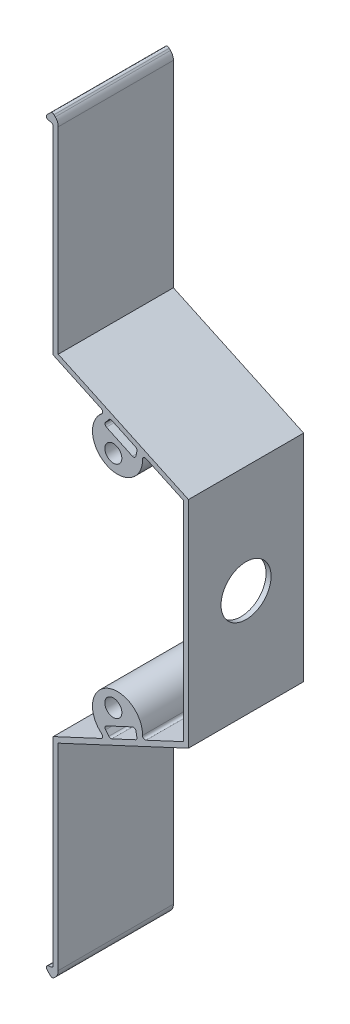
ISO-10303-21;
HEADER;
FILE_DESCRIPTION(('STEP AP214'),'2;1');
FILE_NAME('part.step','',(''),(''),'','','');
FILE_SCHEMA(('AUTOMOTIVE_DESIGN { 1 0 10303 214 1 1 1 1 }'));
ENDSEC;
DATA;
#1=APPLICATION_CONTEXT('core data for automotive mechanical design processes');
#2=APPLICATION_PROTOCOL_DEFINITION('international standard','automotive_design',2000,#1);
#3=PRODUCT_CONTEXT('',#1,'mechanical');
#4=PRODUCT('Part','Part','',(#3));
#5=PRODUCT_RELATED_PRODUCT_CATEGORY('part','',(#4));
#6=PRODUCT_DEFINITION_FORMATION('','',#4);
#7=PRODUCT_DEFINITION_CONTEXT('part definition',#1,'design');
#8=PRODUCT_DEFINITION('design','',#6,#7);
#9=PRODUCT_DEFINITION_SHAPE('','',#8);
#10=(LENGTH_UNIT() NAMED_UNIT(*) SI_UNIT(.MILLI.,.METRE.));
#11=(NAMED_UNIT(*) PLANE_ANGLE_UNIT() SI_UNIT($,.RADIAN.));
#12=(NAMED_UNIT(*) SI_UNIT($,.STERADIAN.) SOLID_ANGLE_UNIT());
#13=UNCERTAINTY_MEASURE_WITH_UNIT(LENGTH_MEASURE(1.E-05),#10,'distance_accuracy_value','');
#14=(GEOMETRIC_REPRESENTATION_CONTEXT(3) GLOBAL_UNCERTAINTY_ASSIGNED_CONTEXT((#13)) GLOBAL_UNIT_ASSIGNED_CONTEXT((#10,
#11,#12)) REPRESENTATION_CONTEXT('',''));
#15=CARTESIAN_POINT('',(0.,0.,0.));
#16=DIRECTION('',(0.,0.,1.));
#17=DIRECTION('',(1.,0.,0.));
#18=AXIS2_PLACEMENT_3D('',#15,#16,#17);
#19=CARTESIAN_POINT('',(0.,0.,0.));
#20=DIRECTION('',(0.,0.,1.));
#21=DIRECTION('',(1.,0.,0.));
#22=AXIS2_PLACEMENT_3D('',#19,#20,#21);
#23=PLANE('',#22);
#24=CARTESIAN_POINT('',(106.,-22.,0.));
#25=DIRECTION('',(0.,0.,1.));
#26=DIRECTION('',(1.,0.,0.));
#27=AXIS2_PLACEMENT_3D('',#24,#25,#26);
#28=CIRCLE('',#27,1.7);
#29=CARTESIAN_POINT('',(104.3,-22.,0.));
#30=VERTEX_POINT('',#29);
#31=EDGE_CURVE('E517',#30,#30,#28,.T.);
#32=ORIENTED_EDGE('',*,*,#31,.T.);
#33=EDGE_LOOP('',(#32));
#34=FACE_BOUND('',#33,.T.);
#35=CARTESIAN_POINT('',(106.,22.,0.));
#36=DIRECTION('',(0.,0.,1.));
#37=DIRECTION('',(1.,0.,0.));
#38=AXIS2_PLACEMENT_3D('',#35,#36,#37);
#39=CIRCLE('',#38,1.7);
#40=CARTESIAN_POINT('',(104.3,22.,0.));
#41=VERTEX_POINT('',#40);
#42=EDGE_CURVE('E513',#41,#41,#39,.T.);
#43=ORIENTED_EDGE('',*,*,#42,.T.);
#44=EDGE_LOOP('',(#43));
#45=FACE_BOUND('',#44,.T.);
#46=DIRECTION('',(0.,1.,0.));
#47=VECTOR('',#46,1.);
#48=CARTESIAN_POINT('',(120.,-1.59645319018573E-13,0.));
#49=LINE('',#48,#47);
#50=CARTESIAN_POINT('',(120.,-20.8629297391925,0.));
#51=VERTEX_POINT('',#50);
#52=CARTESIAN_POINT('',(120.,20.8629297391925,0.));
#53=VERTEX_POINT('',#52);
#54=EDGE_CURVE('E375',#51,#53,#49,.T.);
#55=ORIENTED_EDGE('',*,*,#54,.T.);
#56=DIRECTION('',(-0.906307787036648,0.422618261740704,0.));
#57=VECTOR('',#56,1.);
#58=CARTESIAN_POINT('',(29.4237091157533,63.0993478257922,0.));
#59=LINE('',#58,#57);
#60=CARTESIAN_POINT('',(112.542616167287,24.3403649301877,0.));
#61=VERTEX_POINT('',#60);
#62=EDGE_CURVE('E510',#53,#61,#59,.T.);
#63=ORIENTED_EDGE('',*,*,#62,.T.);
#64=CARTESIAN_POINT('',(112.331307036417,23.8872110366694,0.));
#65=DIRECTION('',(0.,0.,1.));
#66=DIRECTION('',(1.,0.,0.));
#67=AXIS2_PLACEMENT_3D('',#64,#65,#66);
#68=CIRCLE('',#67,0.499999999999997);
#69=CARTESIAN_POINT('',(111.831393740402,23.8778999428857,0.));
#70=VERTEX_POINT('',#69);
#71=EDGE_CURVE('E506',#70,#61,#68,.F.);
#72=ORIENTED_EDGE('',*,*,#71,.F.);
#73=CARTESIAN_POINT('',(106.832260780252,23.7847890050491,0.));
#74=DIRECTION('',(0.,0.,1.));
#75=DIRECTION('',(1.,0.,0.));
#76=AXIS2_PLACEMENT_3D('',#73,#74,#75);
#77=CIRCLE('',#76,4.99999999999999);
#78=CARTESIAN_POINT('',(103.690207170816,27.6741975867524,0.));
#79=VERTEX_POINT('',#78);
#80=EDGE_CURVE('E502',#70,#79,#77,.F.);
#81=ORIENTED_EDGE('',*,*,#80,.T.);
#82=CARTESIAN_POINT('',(103.376001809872,28.0631384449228,0.));
#83=DIRECTION('',(0.,0.,1.));
#84=DIRECTION('',(1.,0.,0.));
#85=AXIS2_PLACEMENT_3D('',#82,#83,#84);
#86=CIRCLE('',#85,0.499999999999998);
#87=CARTESIAN_POINT('',(103.587310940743,28.5162923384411,0.));
#88=VERTEX_POINT('',#87);
#89=EDGE_CURVE('E498',#79,#88,#86,.T.);
#90=ORIENTED_EDGE('',*,*,#89,.T.);
#91=DIRECTION('',(-0.906307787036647,0.422618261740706,0.));
#92=VECTOR('',#91,1.);
#93=CARTESIAN_POINT('',(29.4237091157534,63.0993478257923,0.));
#94=LINE('',#93,#92);
#95=CARTESIAN_POINT('',(94.0000000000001,32.9869288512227,0.));
#96=VERTEX_POINT('',#95);
#97=EDGE_CURVE('E494',#88,#96,#94,.T.);
#98=ORIENTED_EDGE('',*,*,#97,.T.);
#99=DIRECTION('',(0.,1.,0.));
#100=VECTOR('',#99,1.);
#101=CARTESIAN_POINT('',(94.,-2.63820013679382E-13,0.));
#102=LINE('',#101,#100);
#103=CARTESIAN_POINT('',(94.0000000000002,72.5445662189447,0.));
#104=VERTEX_POINT('',#103);
#105=EDGE_CURVE('E490',#96,#104,#102,.T.);
#106=ORIENTED_EDGE('',*,*,#105,.T.);
#107=CARTESIAN_POINT('',(93.5000000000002,72.5445662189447,0.));
#108=DIRECTION('',(0.,0.,1.));
#109=DIRECTION('',(1.,0.,0.));
#110=AXIS2_PLACEMENT_3D('',#107,#108,#109);
#111=CIRCLE('',#110,0.500000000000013);
#112=CARTESIAN_POINT('',(93.5609346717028,73.0408392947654,0.));
#113=VERTEX_POINT('',#112);
#114=EDGE_CURVE('E486',#104,#113,#111,.T.);
#115=ORIENTED_EDGE('',*,*,#114,.T.);
#116=DIRECTION('',(-0.992546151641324,0.121869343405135,0.));
#117=VECTOR('',#116,1.);
#118=CARTESIAN_POINT('',(10.2246689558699,83.2732460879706,0.));
#119=LINE('',#118,#117);
#120=CARTESIAN_POINT('',(93.0646615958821,73.1017739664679,0.));
#121=VERTEX_POINT('',#120);
#122=EDGE_CURVE('E482',#113,#121,#119,.T.);
#123=ORIENTED_EDGE('',*,*,#122,.T.);
#124=CARTESIAN_POINT('',(93.1255962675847,73.5980470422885,0.));
#125=DIRECTION('',(0.,0.,1.));
#126=DIRECTION('',(1.,0.,0.));
#127=AXIS2_PLACEMENT_3D('',#124,#125,#126);
#128=CIRCLE('',#127,0.499999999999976);
#129=CARTESIAN_POINT('',(92.7720428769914,73.9516004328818,0.));
#130=VERTEX_POINT('',#129);
#131=EDGE_CURVE('E478',#121,#130,#128,.F.);
#132=ORIENTED_EDGE('',*,*,#131,.T.);
#133=DIRECTION('',(-0.707106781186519,-0.707106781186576,0.));
#134=VECTOR('',#133,1.);
#135=CARTESIAN_POINT('',(9.41022122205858,-9.41022122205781,0.));
#136=LINE('',#135,#134);
#137=CARTESIAN_POINT('',(93.4500661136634,74.6296236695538,0.));
#138=VERTEX_POINT('',#137);
#139=EDGE_CURVE('E474',#138,#130,#136,.T.);
#140=ORIENTED_EDGE('',*,*,#139,.F.);
#141=CARTESIAN_POINT('',(93.8036195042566,74.2760702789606,0.));
#142=DIRECTION('',(0.,0.,1.));
#143=DIRECTION('',(1.,0.,0.));
#144=AXIS2_PLACEMENT_3D('',#141,#142,#143);
#145=CIRCLE('',#144,0.499999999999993);
#146=CARTESIAN_POINT('',(94.1571728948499,74.6296236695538,0.));
#147=VERTEX_POINT('',#146);
#148=EDGE_CURVE('E470',#147,#138,#145,.T.);
#149=ORIENTED_EDGE('',*,*,#148,.F.);
#150=DIRECTION('',(-0.707106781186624,0.707106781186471,0.));
#151=VECTOR('',#150,1.);
#152=CARTESIAN_POINT('',(84.3933982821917,84.3933982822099,0.));
#153=LINE('',#152,#151);
#154=CARTESIAN_POINT('',(94.4142135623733,74.3725830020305,0.));
#155=VERTEX_POINT('',#154);
#156=EDGE_CURVE('E466',#155,#147,#153,.T.);
#157=ORIENTED_EDGE('',*,*,#156,.F.);
#158=CARTESIAN_POINT('',(93.0000000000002,72.9583694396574,0.));
#159=DIRECTION('',(0.,0.,1.));
#160=DIRECTION('',(1.,0.,0.));
#161=AXIS2_PLACEMENT_3D('',#158,#159,#160);
#162=CIRCLE('',#161,1.9999999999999);
#163=CARTESIAN_POINT('',(95.,72.9583694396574,0.));
#164=VERTEX_POINT('',#163);
#165=EDGE_CURVE('E462',#155,#164,#162,.F.);
#166=ORIENTED_EDGE('',*,*,#165,.T.);
#167=DIRECTION('',(0.,1.,0.));
#168=VECTOR('',#167,1.);
#169=CARTESIAN_POINT('',(95.,0.,0.));
#170=LINE('',#169,#168);
#171=CARTESIAN_POINT('',(95.,33.6239991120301,0.));
#172=VERTEX_POINT('',#171);
#173=EDGE_CURVE('E458',#172,#164,#170,.T.);
#174=ORIENTED_EDGE('',*,*,#173,.F.);
#175=DIRECTION('',(0.906307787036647,-0.422618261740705,0.));
#176=VECTOR('',#175,1.);
#177=CARTESIAN_POINT('',(29.8463273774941,64.0056556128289,0.));
#178=LINE('',#177,#176);
#179=CARTESIAN_POINT('',(121.,21.5,0.));
#180=VERTEX_POINT('',#179);
#181=EDGE_CURVE('E454',#172,#180,#178,.T.);
#182=ORIENTED_EDGE('',*,*,#181,.T.);
#183=DIRECTION('',(0.,1.,0.));
#184=VECTOR('',#183,1.);
#185=CARTESIAN_POINT('',(121.,-1.56205797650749E-13,0.));
#186=LINE('',#185,#184);
#187=CARTESIAN_POINT('',(121.,-21.5,0.));
#188=VERTEX_POINT('',#187);
#189=EDGE_CURVE('E450',#188,#180,#186,.T.);
#190=ORIENTED_EDGE('',*,*,#189,.F.);
#191=DIRECTION('',(0.906307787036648,0.422618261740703,0.));
#192=VECTOR('',#191,1.);
#193=CARTESIAN_POINT('',(29.8463273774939,-64.0056556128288,0.));
#194=LINE('',#193,#192);
#195=CARTESIAN_POINT('',(95.,-33.6239991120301,0.));
#196=VERTEX_POINT('',#195);
#197=EDGE_CURVE('E446',#196,#188,#194,.T.);
#198=ORIENTED_EDGE('',*,*,#197,.F.);
#199=DIRECTION('',(0.,1.,0.));
#200=VECTOR('',#199,1.);
#201=CARTESIAN_POINT('',(95.,0.,0.));
#202=LINE('',#201,#200);
#203=CARTESIAN_POINT('',(95.,-72.9583694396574,0.));
#204=VERTEX_POINT('',#203);
#205=EDGE_CURVE('E442',#204,#196,#202,.T.);
#206=ORIENTED_EDGE('',*,*,#205,.F.);
#207=CARTESIAN_POINT('',(93.,-72.9583694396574,0.));
#208=DIRECTION('',(0.,0.,1.));
#209=DIRECTION('',(1.,0.,0.));
#210=AXIS2_PLACEMENT_3D('',#207,#208,#209);
#211=CIRCLE('',#210,1.99999999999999);
#212=CARTESIAN_POINT('',(94.4142135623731,-74.3725830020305,0.));
#213=VERTEX_POINT('',#212);
#214=EDGE_CURVE('E438',#213,#204,#211,.T.);
#215=ORIENTED_EDGE('',*,*,#214,.F.);
#216=DIRECTION('',(-0.707106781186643,-0.707106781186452,0.));
#217=VECTOR('',#216,1.);
#218=CARTESIAN_POINT('',(84.3933982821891,-84.3933982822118,0.));
#219=LINE('',#218,#217);
#220=CARTESIAN_POINT('',(94.1571728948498,-74.6296236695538,0.));
#221=VERTEX_POINT('',#220);
#222=EDGE_CURVE('E434',#213,#221,#219,.T.);
#223=ORIENTED_EDGE('',*,*,#222,.T.);
#224=CARTESIAN_POINT('',(93.8036195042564,-74.2760702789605,0.));
#225=DIRECTION('',(0.,0.,1.));
#226=DIRECTION('',(1.,0.,0.));
#227=AXIS2_PLACEMENT_3D('',#224,#225,#226);
#228=CIRCLE('',#227,0.499999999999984);
#229=CARTESIAN_POINT('',(93.4500661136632,-74.6296236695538,0.));
#230=VERTEX_POINT('',#229);
#231=EDGE_CURVE('E430',#221,#230,#228,.F.);
#232=ORIENTED_EDGE('',*,*,#231,.T.);
#233=DIRECTION('',(-0.707106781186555,0.70710678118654,0.));
#234=VECTOR('',#233,1.);
#235=CARTESIAN_POINT('',(9.41022122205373,9.41022122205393,0.));
#236=LINE('',#235,#234);
#237=CARTESIAN_POINT('',(92.7720428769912,-73.9516004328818,0.));
#238=VERTEX_POINT('',#237);
#239=EDGE_CURVE('E426',#230,#238,#236,.T.);
#240=ORIENTED_EDGE('',*,*,#239,.T.);
#241=CARTESIAN_POINT('',(93.1255962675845,-73.5980470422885,0.));
#242=DIRECTION('',(0.,0.,1.));
#243=DIRECTION('',(1.,0.,0.));
#244=AXIS2_PLACEMENT_3D('',#241,#242,#243);
#245=CIRCLE('',#244,0.49999999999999);
#246=CARTESIAN_POINT('',(93.0646615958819,-73.1017739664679,0.));
#247=VERTEX_POINT('',#246);
#248=EDGE_CURVE('E422',#247,#238,#245,.T.);
#249=ORIENTED_EDGE('',*,*,#248,.F.);
#250=DIRECTION('',(-0.99254615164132,-0.121869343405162,0.));
#251=VECTOR('',#250,1.);
#252=CARTESIAN_POINT('',(10.2246689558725,-83.2732460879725,0.));
#253=LINE('',#252,#251);
#254=CARTESIAN_POINT('',(93.5609346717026,-73.0408392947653,0.));
#255=VERTEX_POINT('',#254);
#256=EDGE_CURVE('E418',#255,#247,#253,.T.);
#257=ORIENTED_EDGE('',*,*,#256,.F.);
#258=CARTESIAN_POINT('',(93.5,-72.5445662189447,0.));
#259=DIRECTION('',(0.,0.,1.));
#260=DIRECTION('',(1.,0.,0.));
#261=AXIS2_PLACEMENT_3D('',#258,#259,#260);
#262=CIRCLE('',#261,0.499999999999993);
#263=CARTESIAN_POINT('',(94.,-72.5445662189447,0.));
#264=VERTEX_POINT('',#263);
#265=EDGE_CURVE('E414',#264,#255,#262,.F.);
#266=ORIENTED_EDGE('',*,*,#265,.F.);
#267=DIRECTION('',(0.,-1.,0.));
#268=VECTOR('',#267,1.);
#269=CARTESIAN_POINT('',(94.,0.,0.));
#270=LINE('',#269,#268);
#271=CARTESIAN_POINT('',(94.,-32.9869288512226,0.));
#272=VERTEX_POINT('',#271);
#273=EDGE_CURVE('E410',#272,#264,#270,.T.);
#274=ORIENTED_EDGE('',*,*,#273,.F.);
#275=DIRECTION('',(-0.906307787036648,-0.422618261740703,0.));
#276=VECTOR('',#275,1.);
#277=CARTESIAN_POINT('',(29.4237091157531,-63.0993478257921,0.));
#278=LINE('',#277,#276);
#279=CARTESIAN_POINT('',(103.587310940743,-28.5162923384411,0.));
#280=VERTEX_POINT('',#279);
#281=EDGE_CURVE('E406',#280,#272,#278,.T.);
#282=ORIENTED_EDGE('',*,*,#281,.F.);
#283=CARTESIAN_POINT('',(103.376001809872,-28.0631384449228,0.));
#284=DIRECTION('',(0.,0.,1.));
#285=DIRECTION('',(1.,0.,0.));
#286=AXIS2_PLACEMENT_3D('',#283,#284,#285);
#287=CIRCLE('',#286,0.499999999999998);
#288=CARTESIAN_POINT('',(103.690207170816,-27.6741975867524,0.));
#289=VERTEX_POINT('',#288);
#290=EDGE_CURVE('E402',#289,#280,#287,.F.);
#291=ORIENTED_EDGE('',*,*,#290,.F.);
#292=CARTESIAN_POINT('',(106.832260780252,-23.7847890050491,0.));
#293=DIRECTION('',(0.,0.,1.));
#294=DIRECTION('',(1.,0.,0.));
#295=AXIS2_PLACEMENT_3D('',#292,#293,#294);
#296=CIRCLE('',#295,5.);
#297=CARTESIAN_POINT('',(111.831393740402,-23.8778999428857,0.));
#298=VERTEX_POINT('',#297);
#299=EDGE_CURVE('E398',#298,#289,#296,.T.);
#300=ORIENTED_EDGE('',*,*,#299,.F.);
#301=CARTESIAN_POINT('',(112.331307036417,-23.8872110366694,0.));
#302=DIRECTION('',(0.,0.,1.));
#303=DIRECTION('',(1.,0.,0.));
#304=AXIS2_PLACEMENT_3D('',#301,#302,#303);
#305=CIRCLE('',#304,0.499999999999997);
#306=CARTESIAN_POINT('',(112.542616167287,-24.3403649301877,0.));
#307=VERTEX_POINT('',#306);
#308=EDGE_CURVE('E379',#307,#298,#305,.F.);
#309=ORIENTED_EDGE('',*,*,#308,.F.);
#310=DIRECTION('',(-0.906307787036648,-0.422618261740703,0.));
#311=VECTOR('',#310,1.);
#312=CARTESIAN_POINT('',(29.4237091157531,-63.0993478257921,0.));
#313=LINE('',#312,#311);
#314=EDGE_CURVE('E361',#51,#307,#313,.T.);
#315=ORIENTED_EDGE('',*,*,#314,.F.);
#316=EDGE_LOOP('',(#55,#63,#72,#81,#90,#98,#106,#115,#123,#132,#140,#149,#157,#166,#174,#182,
#190,#198,#206,#215,#223,#232,#240,#249,#257,#266,#274,#282,#291,#300,#309,#315));
#317=FACE_BOUND('',#316,.T.);
#318=DIRECTION('',(0.906307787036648,-0.422618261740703,0.));
#319=VECTOR('',#318,1.);
#320=CARTESIAN_POINT('',(105.346040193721,27.6961834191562,0.));
#321=LINE('',#320,#319);
#322=CARTESIAN_POINT('',(105.69985206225,27.5311982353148,0.));
#323=VERTEX_POINT('',#322);
#324=CARTESIAN_POINT('',(110.430075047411,25.3254590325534,0.));
#325=VERTEX_POINT('',#324);
#326=EDGE_CURVE('E795',#323,#325,#321,.T.);
#327=ORIENTED_EDGE('',*,*,#326,.F.);
#328=CARTESIAN_POINT('',(105.48854293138,27.0780443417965,0.));
#329=DIRECTION('',(0.,0.,1.));
#330=DIRECTION('',(1.,0.,0.));
#331=AXIS2_PLACEMENT_3D('',#328,#329,#330);
#332=CIRCLE('',#331,0.5);
#333=CARTESIAN_POINT('',(105.100169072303,27.3929502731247,0.));
#334=VERTEX_POINT('',#333);
#335=EDGE_CURVE('E685',#323,#334,#332,.T.);
#336=ORIENTED_EDGE('',*,*,#335,.T.);
#337=DIRECTION('',(0.629811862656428,0.776747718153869,0.));
#338=VECTOR('',#337,1.);
#339=CARTESIAN_POINT('',(105.346040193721,27.6961834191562,0.));
#340=LINE('',#339,#338);
#341=CARTESIAN_POINT('',(104.450973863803,26.5922970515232,0.));
#342=VERTEX_POINT('',#341);
#343=EDGE_CURVE('E390',#342,#334,#340,.T.);
#344=ORIENTED_EDGE('',*,*,#343,.F.);
#345=CARTESIAN_POINT('',(104.83934772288,26.277391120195,0.));
#346=DIRECTION('',(0.,0.,1.));
#347=DIRECTION('',(1.,0.,0.));
#348=AXIS2_PLACEMENT_3D('',#345,#346,#347);
#349=CIRCLE('',#348,0.5);
#350=CARTESIAN_POINT('',(104.628038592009,25.8242372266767,0.));
#351=VERTEX_POINT('',#350);
#352=EDGE_CURVE('E679',#342,#351,#349,.T.);
#353=ORIENTED_EDGE('',*,*,#352,.T.);
#354=DIRECTION('',(-0.906307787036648,0.422618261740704,0.));
#355=VECTOR('',#354,1.);
#356=CARTESIAN_POINT('',(104.047649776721,26.0948769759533,0.));
#357=LINE('',#356,#355);
#358=CARTESIAN_POINT('',(109.811415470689,23.4071888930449,0.));
#359=VERTEX_POINT('',#358);
#360=EDGE_CURVE('E386',#359,#351,#357,.T.);
#361=ORIENTED_EDGE('',*,*,#360,.F.);
#362=CARTESIAN_POINT('',(110.022724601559,23.8603427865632,0.));
#363=DIRECTION('',(0.,0.,1.));
#364=DIRECTION('',(1.,0.,0.));
#365=AXIS2_PLACEMENT_3D('',#362,#363,#364);
#366=CIRCLE('',#365,0.5);
#367=CARTESIAN_POINT('',(110.513598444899,23.7652487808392,0.));
#368=VERTEX_POINT('',#367);
#369=EDGE_CURVE('E697',#359,#368,#366,.T.);
#370=ORIENTED_EDGE('',*,*,#369,.T.);
#371=DIRECTION('',(-0.190188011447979,-0.981747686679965,0.));
#372=VECTOR('',#371,1.);
#373=CARTESIAN_POINT('',(110.78388691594,25.160473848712,0.));
#374=LINE('',#373,#372);
#375=CARTESIAN_POINT('',(110.709639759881,24.7772111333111,0.));
#376=VERTEX_POINT('',#375);
#377=EDGE_CURVE('E791',#376,#368,#374,.T.);
#378=ORIENTED_EDGE('',*,*,#377,.F.);
#379=CARTESIAN_POINT('',(110.218765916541,24.872305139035,0.));
#380=DIRECTION('',(0.,0.,1.));
#381=DIRECTION('',(1.,0.,0.));
#382=AXIS2_PLACEMENT_3D('',#379,#380,#381);
#383=CIRCLE('',#382,0.5);
#384=EDGE_CURVE('E691',#376,#325,#383,.T.);
#385=ORIENTED_EDGE('',*,*,#384,.T.);
#386=EDGE_LOOP('',(#327,#336,#344,#353,#361,#370,#378,#385));
#387=FACE_BOUND('',#386,.T.);
#388=DIRECTION('',(0.629811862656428,-0.776747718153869,0.));
#389=VECTOR('',#388,1.);
#390=CARTESIAN_POINT('',(105.346040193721,-27.6961834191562,0.));
#391=LINE('',#390,#389);
#392=CARTESIAN_POINT('',(104.450973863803,-26.5922970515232,0.));
#393=VERTEX_POINT('',#392);
#394=CARTESIAN_POINT('',(105.100169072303,-27.3929502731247,0.));
#395=VERTEX_POINT('',#394);
#396=EDGE_CURVE('E770',#393,#395,#391,.T.);
#397=ORIENTED_EDGE('',*,*,#396,.T.);
#398=CARTESIAN_POINT('',(105.48854293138,-27.0780443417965,0.));
#399=DIRECTION('',(0.,0.,1.));
#400=DIRECTION('',(1.,0.,0.));
#401=AXIS2_PLACEMENT_3D('',#398,#399,#400);
#402=CIRCLE('',#401,0.5);
#403=CARTESIAN_POINT('',(105.69985206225,-27.5311982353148,0.));
#404=VERTEX_POINT('',#403);
#405=EDGE_CURVE('E736',#395,#404,#402,.T.);
#406=ORIENTED_EDGE('',*,*,#405,.T.);
#407=DIRECTION('',(0.906307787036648,0.422618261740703,0.));
#408=VECTOR('',#407,1.);
#409=CARTESIAN_POINT('',(105.346040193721,-27.6961834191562,0.));
#410=LINE('',#409,#408);
#411=CARTESIAN_POINT('',(110.430075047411,-25.3254590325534,0.));
#412=VERTEX_POINT('',#411);
#413=EDGE_CURVE('E776',#404,#412,#410,.T.);
#414=ORIENTED_EDGE('',*,*,#413,.T.);
#415=CARTESIAN_POINT('',(110.218765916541,-24.872305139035,0.));
#416=DIRECTION('',(0.,0.,1.));
#417=DIRECTION('',(1.,0.,0.));
#418=AXIS2_PLACEMENT_3D('',#415,#416,#417);
#419=CIRCLE('',#418,0.5);
#420=CARTESIAN_POINT('',(110.709639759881,-24.7772111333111,0.));
#421=VERTEX_POINT('',#420);
#422=EDGE_CURVE('E72',#412,#421,#419,.T.);
#423=ORIENTED_EDGE('',*,*,#422,.T.);
#424=DIRECTION('',(-0.190188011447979,0.981747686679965,0.));
#425=VECTOR('',#424,1.);
#426=CARTESIAN_POINT('',(110.78388691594,-25.160473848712,0.));
#427=LINE('',#426,#425);
#428=CARTESIAN_POINT('',(110.513598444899,-23.7652487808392,0.));
#429=VERTEX_POINT('',#428);
#430=EDGE_CURVE('E765',#421,#429,#427,.T.);
#431=ORIENTED_EDGE('',*,*,#430,.T.);
#432=CARTESIAN_POINT('',(110.022724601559,-23.8603427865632,0.));
#433=DIRECTION('',(0.,0.,1.));
#434=DIRECTION('',(1.,0.,0.));
#435=AXIS2_PLACEMENT_3D('',#432,#433,#434);
#436=CIRCLE('',#435,0.5);
#437=CARTESIAN_POINT('',(109.811415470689,-23.4071888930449,0.));
#438=VERTEX_POINT('',#437);
#439=EDGE_CURVE('E11',#429,#438,#436,.T.);
#440=ORIENTED_EDGE('',*,*,#439,.T.);
#441=DIRECTION('',(-0.906307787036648,-0.422618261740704,0.));
#442=VECTOR('',#441,1.);
#443=CARTESIAN_POINT('',(104.047649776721,-26.0948769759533,0.));
#444=LINE('',#443,#442);
#445=CARTESIAN_POINT('',(104.628038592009,-25.8242372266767,0.));
#446=VERTEX_POINT('',#445);
#447=EDGE_CURVE('E763',#438,#446,#444,.T.);
#448=ORIENTED_EDGE('',*,*,#447,.T.);
#449=CARTESIAN_POINT('',(104.83934772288,-26.277391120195,0.));
#450=DIRECTION('',(0.,0.,1.));
#451=DIRECTION('',(1.,0.,0.));
#452=AXIS2_PLACEMENT_3D('',#449,#450,#451);
#453=CIRCLE('',#452,0.5);
#454=EDGE_CURVE('E730',#446,#393,#453,.T.);
#455=ORIENTED_EDGE('',*,*,#454,.T.);
#456=EDGE_LOOP('',(#397,#406,#414,#423,#431,#440,#448,#455));
#457=FACE_BOUND('',#456,.T.);
#458=ADVANCED_FACE('F48',(#34,#45,#317,#387,#457),#23,.F.);
#459=CARTESIAN_POINT('',(0.,0.,23.));
#460=DIRECTION('',(0.,0.,1.));
#461=DIRECTION('',(0.,-1.,0.));
#462=AXIS2_PLACEMENT_3D('',#459,#460,#461);
#463=PLANE('',#462);
#464=DIRECTION('',(-0.629811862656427,-0.776747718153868,0.));
#465=VECTOR('',#464,1.);
#466=CARTESIAN_POINT('',(105.346040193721,27.6961834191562,23.));
#467=LINE('',#466,#465);
#468=CARTESIAN_POINT('',(105.100169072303,27.3929502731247,23.));
#469=VERTEX_POINT('',#468);
#470=CARTESIAN_POINT('',(104.450973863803,26.5922970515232,23.));
#471=VERTEX_POINT('',#470);
#472=EDGE_CURVE('E774',#469,#471,#467,.T.);
#473=ORIENTED_EDGE('',*,*,#472,.F.);
#474=CARTESIAN_POINT('',(105.48854293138,27.0780443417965,23.));
#475=DIRECTION('',(0.,0.,1.));
#476=DIRECTION('',(1.,0.,0.));
#477=AXIS2_PLACEMENT_3D('',#474,#475,#476);
#478=CIRCLE('',#477,0.5);
#479=CARTESIAN_POINT('',(105.69985206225,27.5311982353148,23.));
#480=VERTEX_POINT('',#479);
#481=EDGE_CURVE('E682',#469,#480,#478,.F.);
#482=ORIENTED_EDGE('',*,*,#481,.T.);
#483=DIRECTION('',(-0.906307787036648,0.422618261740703,0.));
#484=VECTOR('',#483,1.);
#485=CARTESIAN_POINT('',(105.346040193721,27.6961834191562,23.));
#486=LINE('',#485,#484);
#487=CARTESIAN_POINT('',(110.430075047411,25.3254590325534,23.));
#488=VERTEX_POINT('',#487);
#489=EDGE_CURVE('E796',#488,#480,#486,.T.);
#490=ORIENTED_EDGE('',*,*,#489,.F.);
#491=CARTESIAN_POINT('',(110.218765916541,24.872305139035,23.));
#492=DIRECTION('',(0.,0.,1.));
#493=DIRECTION('',(1.,0.,0.));
#494=AXIS2_PLACEMENT_3D('',#491,#492,#493);
#495=CIRCLE('',#494,0.5);
#496=CARTESIAN_POINT('',(110.709639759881,24.7772111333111,23.));
#497=VERTEX_POINT('',#496);
#498=EDGE_CURVE('E688',#488,#497,#495,.F.);
#499=ORIENTED_EDGE('',*,*,#498,.T.);
#500=DIRECTION('',(0.190188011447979,0.981747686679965,0.));
#501=VECTOR('',#500,1.);
#502=CARTESIAN_POINT('',(110.78388691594,25.160473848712,23.));
#503=LINE('',#502,#501);
#504=CARTESIAN_POINT('',(110.513598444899,23.7652487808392,23.));
#505=VERTEX_POINT('',#504);
#506=EDGE_CURVE('E810',#505,#497,#503,.T.);
#507=ORIENTED_EDGE('',*,*,#506,.F.);
#508=CARTESIAN_POINT('',(110.022724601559,23.8603427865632,23.));
#509=DIRECTION('',(0.,0.,1.));
#510=DIRECTION('',(1.,0.,0.));
#511=AXIS2_PLACEMENT_3D('',#508,#509,#510);
#512=CIRCLE('',#511,0.5);
#513=CARTESIAN_POINT('',(109.811415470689,23.4071888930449,23.));
#514=VERTEX_POINT('',#513);
#515=EDGE_CURVE('E694',#505,#514,#512,.F.);
#516=ORIENTED_EDGE('',*,*,#515,.T.);
#517=DIRECTION('',(0.906307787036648,-0.422618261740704,0.));
#518=VECTOR('',#517,1.);
#519=CARTESIAN_POINT('',(104.047649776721,26.0948769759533,23.));
#520=LINE('',#519,#518);
#521=CARTESIAN_POINT('',(104.628038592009,25.8242372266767,23.));
#522=VERTEX_POINT('',#521);
#523=EDGE_CURVE('E806',#522,#514,#520,.T.);
#524=ORIENTED_EDGE('',*,*,#523,.F.);
#525=CARTESIAN_POINT('',(104.83934772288,26.277391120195,23.));
#526=DIRECTION('',(0.,0.,1.));
#527=DIRECTION('',(1.,0.,0.));
#528=AXIS2_PLACEMENT_3D('',#525,#526,#527);
#529=CIRCLE('',#528,0.5);
#530=EDGE_CURVE('E676',#522,#471,#529,.F.);
#531=ORIENTED_EDGE('',*,*,#530,.T.);
#532=EDGE_LOOP('',(#473,#482,#490,#499,#507,#516,#524,#531));
#533=FACE_BOUND('',#532,.T.);
#534=CARTESIAN_POINT('',(106.,22.,23.));
#535=DIRECTION('',(0.,0.,1.));
#536=DIRECTION('',(1.,0.,0.));
#537=AXIS2_PLACEMENT_3D('',#534,#535,#536);
#538=CIRCLE('',#537,1.7);
#539=CARTESIAN_POINT('',(104.3,22.,23.));
#540=VERTEX_POINT('',#539);
#541=EDGE_CURVE('E393',#540,#540,#538,.T.);
#542=ORIENTED_EDGE('',*,*,#541,.F.);
#543=EDGE_LOOP('',(#542));
#544=FACE_BOUND('',#543,.T.);
#545=CARTESIAN_POINT('',(106.,-22.,23.));
#546=DIRECTION('',(0.,0.,1.));
#547=DIRECTION('',(1.,0.,0.));
#548=AXIS2_PLACEMENT_3D('',#545,#546,#547);
#549=CIRCLE('',#548,1.7);
#550=CARTESIAN_POINT('',(104.3,-22.,23.));
#551=VERTEX_POINT('',#550);
#552=EDGE_CURVE('E612',#551,#551,#549,.T.);
#553=ORIENTED_EDGE('',*,*,#552,.F.);
#554=EDGE_LOOP('',(#553));
#555=FACE_BOUND('',#554,.T.);
#556=DIRECTION('',(-0.707106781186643,-0.707106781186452,0.));
#557=VECTOR('',#556,1.);
#558=CARTESIAN_POINT('',(84.3933982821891,-84.3933982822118,23.));
#559=LINE('',#558,#557);
#560=CARTESIAN_POINT('',(94.4142135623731,-74.3725830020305,23.));
#561=VERTEX_POINT('',#560);
#562=CARTESIAN_POINT('',(94.1571728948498,-74.6296236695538,23.));
#563=VERTEX_POINT('',#562);
#564=EDGE_CURVE('E644',#561,#563,#559,.T.);
#565=ORIENTED_EDGE('',*,*,#564,.F.);
#566=CARTESIAN_POINT('',(93.,-72.9583694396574,23.));
#567=DIRECTION('',(0.,0.,1.));
#568=DIRECTION('',(1.,0.,0.));
#569=AXIS2_PLACEMENT_3D('',#566,#567,#568);
#570=CIRCLE('',#569,1.99999999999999);
#571=CARTESIAN_POINT('',(95.,-72.9583694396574,23.));
#572=VERTEX_POINT('',#571);
#573=EDGE_CURVE('E641',#561,#572,#570,.T.);
#574=ORIENTED_EDGE('',*,*,#573,.T.);
#575=DIRECTION('',(0.,1.,0.));
#576=VECTOR('',#575,1.);
#577=CARTESIAN_POINT('',(95.,0.,23.));
#578=LINE('',#577,#576);
#579=CARTESIAN_POINT('',(95.,-33.6239991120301,23.));
#580=VERTEX_POINT('',#579);
#581=EDGE_CURVE('E638',#572,#580,#578,.T.);
#582=ORIENTED_EDGE('',*,*,#581,.T.);
#583=DIRECTION('',(0.906307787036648,0.422618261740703,0.));
#584=VECTOR('',#583,1.);
#585=CARTESIAN_POINT('',(29.8463273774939,-64.0056556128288,23.));
#586=LINE('',#585,#584);
#587=CARTESIAN_POINT('',(121.,-21.5,23.));
#588=VERTEX_POINT('',#587);
#589=EDGE_CURVE('E635',#580,#588,#586,.T.);
#590=ORIENTED_EDGE('',*,*,#589,.T.);
#591=DIRECTION('',(0.,1.,0.));
#592=VECTOR('',#591,1.);
#593=CARTESIAN_POINT('',(121.,-1.56205797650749E-13,23.));
#594=LINE('',#593,#592);
#595=CARTESIAN_POINT('',(121.,21.5,23.));
#596=VERTEX_POINT('',#595);
#597=EDGE_CURVE('E632',#588,#596,#594,.T.);
#598=ORIENTED_EDGE('',*,*,#597,.T.);
#599=DIRECTION('',(0.906307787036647,-0.422618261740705,0.));
#600=VECTOR('',#599,1.);
#601=CARTESIAN_POINT('',(29.8463273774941,64.0056556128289,23.));
#602=LINE('',#601,#600);
#603=CARTESIAN_POINT('',(95.,33.6239991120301,23.));
#604=VERTEX_POINT('',#603);
#605=EDGE_CURVE('E628',#604,#596,#602,.T.);
#606=ORIENTED_EDGE('',*,*,#605,.F.);
#607=DIRECTION('',(0.,1.,0.));
#608=VECTOR('',#607,1.);
#609=CARTESIAN_POINT('',(95.,0.,23.));
#610=LINE('',#609,#608);
#611=CARTESIAN_POINT('',(95.,72.9583694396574,23.));
#612=VERTEX_POINT('',#611);
#613=EDGE_CURVE('E625',#604,#612,#610,.T.);
#614=ORIENTED_EDGE('',*,*,#613,.T.);
#615=CARTESIAN_POINT('',(93.0000000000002,72.9583694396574,23.));
#616=DIRECTION('',(0.,0.,1.));
#617=DIRECTION('',(1.,0.,0.));
#618=AXIS2_PLACEMENT_3D('',#615,#616,#617);
#619=CIRCLE('',#618,1.9999999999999);
#620=CARTESIAN_POINT('',(94.4142135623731,74.3725830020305,23.));
#621=VERTEX_POINT('',#620);
#622=EDGE_CURVE('E620',#621,#612,#619,.F.);
#623=ORIENTED_EDGE('',*,*,#622,.F.);
#624=DIRECTION('',(-0.707106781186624,0.707106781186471,0.));
#625=VECTOR('',#624,1.);
#626=CARTESIAN_POINT('',(84.3933982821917,84.3933982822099,23.));
#627=LINE('',#626,#625);
#628=CARTESIAN_POINT('',(94.1571728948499,74.6296236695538,23.));
#629=VERTEX_POINT('',#628);
#630=EDGE_CURVE('E617',#621,#629,#627,.T.);
#631=ORIENTED_EDGE('',*,*,#630,.T.);
#632=CARTESIAN_POINT('',(93.8036195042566,74.2760702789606,23.));
#633=DIRECTION('',(0.,0.,1.));
#634=DIRECTION('',(1.,0.,0.));
#635=AXIS2_PLACEMENT_3D('',#632,#633,#634);
#636=CIRCLE('',#635,0.499999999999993);
#637=CARTESIAN_POINT('',(93.4500661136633,74.6296236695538,23.));
#638=VERTEX_POINT('',#637);
#639=EDGE_CURVE('E621',#629,#638,#636,.T.);
#640=ORIENTED_EDGE('',*,*,#639,.T.);
#641=DIRECTION('',(-0.707106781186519,-0.707106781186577,0.));
#642=VECTOR('',#641,1.);
#643=CARTESIAN_POINT('',(9.41022122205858,-9.41022122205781,23.));
#644=LINE('',#643,#642);
#645=CARTESIAN_POINT('',(92.7720428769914,73.9516004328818,23.));
#646=VERTEX_POINT('',#645);
#647=EDGE_CURVE('E851',#638,#646,#644,.T.);
#648=ORIENTED_EDGE('',*,*,#647,.T.);
#649=CARTESIAN_POINT('',(93.1255962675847,73.5980470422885,23.));
#650=DIRECTION('',(0.,0.,1.));
#651=DIRECTION('',(1.,0.,0.));
#652=AXIS2_PLACEMENT_3D('',#649,#650,#651);
#653=CIRCLE('',#652,0.499999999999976);
#654=CARTESIAN_POINT('',(93.0646615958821,73.1017739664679,23.));
#655=VERTEX_POINT('',#654);
#656=EDGE_CURVE('E847',#655,#646,#653,.F.);
#657=ORIENTED_EDGE('',*,*,#656,.F.);
#658=DIRECTION('',(-0.992546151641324,0.121869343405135,0.));
#659=VECTOR('',#658,1.);
#660=CARTESIAN_POINT('',(10.2246689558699,83.2732460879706,23.));
#661=LINE('',#660,#659);
#662=CARTESIAN_POINT('',(93.5609346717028,73.0408392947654,23.));
#663=VERTEX_POINT('',#662);
#664=EDGE_CURVE('E843',#663,#655,#661,.T.);
#665=ORIENTED_EDGE('',*,*,#664,.F.);
#666=CARTESIAN_POINT('',(93.5000000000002,72.5445662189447,23.));
#667=DIRECTION('',(0.,0.,1.));
#668=DIRECTION('',(1.,0.,0.));
#669=AXIS2_PLACEMENT_3D('',#666,#667,#668);
#670=CIRCLE('',#669,0.500000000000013);
#671=CARTESIAN_POINT('',(94.0000000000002,72.5445662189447,23.));
#672=VERTEX_POINT('',#671);
#673=EDGE_CURVE('E839',#672,#663,#670,.T.);
#674=ORIENTED_EDGE('',*,*,#673,.F.);
#675=DIRECTION('',(0.,1.,0.));
#676=VECTOR('',#675,1.);
#677=CARTESIAN_POINT('',(94.,-2.63820013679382E-13,23.));
#678=LINE('',#677,#676);
#679=CARTESIAN_POINT('',(94.0000000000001,32.9869288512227,23.));
#680=VERTEX_POINT('',#679);
#681=EDGE_CURVE('E835',#680,#672,#678,.T.);
#682=ORIENTED_EDGE('',*,*,#681,.F.);
#683=DIRECTION('',(-0.906307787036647,0.422618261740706,0.));
#684=VECTOR('',#683,1.);
#685=CARTESIAN_POINT('',(29.4237091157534,63.0993478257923,23.));
#686=LINE('',#685,#684);
#687=CARTESIAN_POINT('',(103.587310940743,28.5162923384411,23.));
#688=VERTEX_POINT('',#687);
#689=EDGE_CURVE('E831',#688,#680,#686,.T.);
#690=ORIENTED_EDGE('',*,*,#689,.F.);
#691=CARTESIAN_POINT('',(103.376001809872,28.0631384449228,23.));
#692=DIRECTION('',(0.,0.,1.));
#693=DIRECTION('',(1.,0.,0.));
#694=AXIS2_PLACEMENT_3D('',#691,#692,#693);
#695=CIRCLE('',#694,0.499999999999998);
#696=CARTESIAN_POINT('',(103.690207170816,27.6741975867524,23.));
#697=VERTEX_POINT('',#696);
#698=EDGE_CURVE('E827',#697,#688,#695,.T.);
#699=ORIENTED_EDGE('',*,*,#698,.F.);
#700=CARTESIAN_POINT('',(106.832260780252,23.7847890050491,23.));
#701=DIRECTION('',(0.,0.,1.));
#702=DIRECTION('',(1.,0.,0.));
#703=AXIS2_PLACEMENT_3D('',#700,#701,#702);
#704=CIRCLE('',#703,4.99999999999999);
#705=CARTESIAN_POINT('',(111.831393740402,23.8778999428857,23.));
#706=VERTEX_POINT('',#705);
#707=EDGE_CURVE('E823',#706,#697,#704,.F.);
#708=ORIENTED_EDGE('',*,*,#707,.F.);
#709=CARTESIAN_POINT('',(112.331307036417,23.8872110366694,23.));
#710=DIRECTION('',(0.,0.,1.));
#711=DIRECTION('',(1.,0.,0.));
#712=AXIS2_PLACEMENT_3D('',#709,#710,#711);
#713=CIRCLE('',#712,0.499999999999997);
#714=CARTESIAN_POINT('',(112.542616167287,24.3403649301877,23.));
#715=VERTEX_POINT('',#714);
#716=EDGE_CURVE('E820',#706,#715,#713,.F.);
#717=ORIENTED_EDGE('',*,*,#716,.T.);
#718=DIRECTION('',(-0.906307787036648,0.422618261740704,0.));
#719=VECTOR('',#718,1.);
#720=CARTESIAN_POINT('',(29.4237091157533,63.0993478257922,23.));
#721=LINE('',#720,#719);
#722=CARTESIAN_POINT('',(120.,20.8629297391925,23.));
#723=VERTEX_POINT('',#722);
#724=EDGE_CURVE('E368',#723,#715,#721,.T.);
#725=ORIENTED_EDGE('',*,*,#724,.F.);
#726=DIRECTION('',(0.,1.,0.));
#727=VECTOR('',#726,1.);
#728=CARTESIAN_POINT('',(120.,-1.59645319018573E-13,23.));
#729=LINE('',#728,#727);
#730=CARTESIAN_POINT('',(120.,-20.8629297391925,23.));
#731=VERTEX_POINT('',#730);
#732=EDGE_CURVE('E856',#731,#723,#729,.T.);
#733=ORIENTED_EDGE('',*,*,#732,.F.);
#734=DIRECTION('',(-0.906307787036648,-0.422618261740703,0.));
#735=VECTOR('',#734,1.);
#736=CARTESIAN_POINT('',(29.4237091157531,-63.0993478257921,23.));
#737=LINE('',#736,#735);
#738=CARTESIAN_POINT('',(112.542616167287,-24.3403649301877,23.));
#739=VERTEX_POINT('',#738);
#740=EDGE_CURVE('E363',#731,#739,#737,.T.);
#741=ORIENTED_EDGE('',*,*,#740,.T.);
#742=CARTESIAN_POINT('',(112.331307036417,-23.8872110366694,23.));
#743=DIRECTION('',(0.,0.,1.));
#744=DIRECTION('',(1.,0.,0.));
#745=AXIS2_PLACEMENT_3D('',#742,#743,#744);
#746=CIRCLE('',#745,0.499999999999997);
#747=CARTESIAN_POINT('',(111.831393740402,-23.8778999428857,23.));
#748=VERTEX_POINT('',#747);
#749=EDGE_CURVE('E861',#739,#748,#746,.F.);
#750=ORIENTED_EDGE('',*,*,#749,.T.);
#751=CARTESIAN_POINT('',(106.832260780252,-23.7847890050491,23.));
#752=DIRECTION('',(0.,0.,1.));
#753=DIRECTION('',(1.,0.,0.));
#754=AXIS2_PLACEMENT_3D('',#751,#752,#753);
#755=CIRCLE('',#754,5.);
#756=CARTESIAN_POINT('',(103.690207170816,-27.6741975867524,23.));
#757=VERTEX_POINT('',#756);
#758=EDGE_CURVE('E864',#748,#757,#755,.T.);
#759=ORIENTED_EDGE('',*,*,#758,.T.);
#760=CARTESIAN_POINT('',(103.376001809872,-28.0631384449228,23.));
#761=DIRECTION('',(0.,0.,1.));
#762=DIRECTION('',(1.,0.,0.));
#763=AXIS2_PLACEMENT_3D('',#760,#761,#762);
#764=CIRCLE('',#763,0.499999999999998);
#765=CARTESIAN_POINT('',(103.587310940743,-28.5162923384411,23.));
#766=VERTEX_POINT('',#765);
#767=EDGE_CURVE('E867',#757,#766,#764,.F.);
#768=ORIENTED_EDGE('',*,*,#767,.T.);
#769=DIRECTION('',(-0.906307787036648,-0.422618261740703,0.));
#770=VECTOR('',#769,1.);
#771=CARTESIAN_POINT('',(29.4237091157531,-63.0993478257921,23.));
#772=LINE('',#771,#770);
#773=CARTESIAN_POINT('',(94.,-32.9869288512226,23.));
#774=VERTEX_POINT('',#773);
#775=EDGE_CURVE('E870',#766,#774,#772,.T.);
#776=ORIENTED_EDGE('',*,*,#775,.T.);
#777=DIRECTION('',(0.,-1.,0.));
#778=VECTOR('',#777,1.);
#779=CARTESIAN_POINT('',(94.,0.,23.));
#780=LINE('',#779,#778);
#781=CARTESIAN_POINT('',(94.,-72.5445662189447,23.));
#782=VERTEX_POINT('',#781);
#783=EDGE_CURVE('E873',#774,#782,#780,.T.);
#784=ORIENTED_EDGE('',*,*,#783,.T.);
#785=CARTESIAN_POINT('',(93.5,-72.5445662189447,23.));
#786=DIRECTION('',(0.,0.,1.));
#787=DIRECTION('',(1.,0.,0.));
#788=AXIS2_PLACEMENT_3D('',#785,#786,#787);
#789=CIRCLE('',#788,0.499999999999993);
#790=CARTESIAN_POINT('',(93.5609346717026,-73.0408392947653,23.));
#791=VERTEX_POINT('',#790);
#792=EDGE_CURVE('E876',#782,#791,#789,.F.);
#793=ORIENTED_EDGE('',*,*,#792,.T.);
#794=DIRECTION('',(-0.99254615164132,-0.121869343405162,0.));
#795=VECTOR('',#794,1.);
#796=CARTESIAN_POINT('',(10.2246689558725,-83.2732460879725,23.));
#797=LINE('',#796,#795);
#798=CARTESIAN_POINT('',(93.0646615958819,-73.1017739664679,23.));
#799=VERTEX_POINT('',#798);
#800=EDGE_CURVE('E879',#791,#799,#797,.T.);
#801=ORIENTED_EDGE('',*,*,#800,.T.);
#802=CARTESIAN_POINT('',(93.1255962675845,-73.5980470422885,23.));
#803=DIRECTION('',(0.,0.,1.));
#804=DIRECTION('',(1.,0.,0.));
#805=AXIS2_PLACEMENT_3D('',#802,#803,#804);
#806=CIRCLE('',#805,0.49999999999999);
#807=CARTESIAN_POINT('',(92.7720428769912,-73.9516004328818,23.));
#808=VERTEX_POINT('',#807);
#809=EDGE_CURVE('E882',#799,#808,#806,.T.);
#810=ORIENTED_EDGE('',*,*,#809,.T.);
#811=DIRECTION('',(-0.707106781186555,0.70710678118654,0.));
#812=VECTOR('',#811,1.);
#813=CARTESIAN_POINT('',(9.41022122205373,9.41022122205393,23.));
#814=LINE('',#813,#812);
#815=CARTESIAN_POINT('',(93.4500661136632,-74.6296236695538,23.));
#816=VERTEX_POINT('',#815);
#817=EDGE_CURVE('E885',#816,#808,#814,.T.);
#818=ORIENTED_EDGE('',*,*,#817,.F.);
#819=CARTESIAN_POINT('',(93.8036195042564,-74.2760702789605,23.));
#820=DIRECTION('',(0.,0.,1.));
#821=DIRECTION('',(1.,0.,0.));
#822=AXIS2_PLACEMENT_3D('',#819,#820,#821);
#823=CIRCLE('',#822,0.499999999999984);
#824=EDGE_CURVE('E648',#563,#816,#823,.F.);
#825=ORIENTED_EDGE('',*,*,#824,.F.);
#826=EDGE_LOOP('',(#565,#574,#582,#590,#598,#606,#614,#623,#631,#640,#648,#657,#665,#674,#682,
#690,#699,#708,#717,#725,#733,#741,#750,#759,#768,#776,#784,#793,#801,#810,#818,#825));
#827=FACE_BOUND('',#826,.T.);
#828=DIRECTION('',(0.906307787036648,0.422618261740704,0.));
#829=VECTOR('',#828,1.);
#830=CARTESIAN_POINT('',(104.047649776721,-26.0948769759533,23.));
#831=LINE('',#830,#829);
#832=CARTESIAN_POINT('',(104.628038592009,-25.8242372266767,23.));
#833=VERTEX_POINT('',#832);
#834=CARTESIAN_POINT('',(109.811415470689,-23.4071888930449,23.));
#835=VERTEX_POINT('',#834);
#836=EDGE_CURVE('E751',#833,#835,#831,.T.);
#837=ORIENTED_EDGE('',*,*,#836,.T.);
#838=CARTESIAN_POINT('',(110.022724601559,-23.8603427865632,23.));
#839=DIRECTION('',(0.,0.,1.));
#840=DIRECTION('',(1.,0.,0.));
#841=AXIS2_PLACEMENT_3D('',#838,#839,#840);
#842=CIRCLE('',#841,0.5);
#843=CARTESIAN_POINT('',(110.513598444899,-23.7652487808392,23.));
#844=VERTEX_POINT('',#843);
#845=EDGE_CURVE('E58',#835,#844,#842,.F.);
#846=ORIENTED_EDGE('',*,*,#845,.T.);
#847=DIRECTION('',(0.190188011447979,-0.981747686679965,0.));
#848=VECTOR('',#847,1.);
#849=CARTESIAN_POINT('',(110.78388691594,-25.160473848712,23.));
#850=LINE('',#849,#848);
#851=CARTESIAN_POINT('',(110.709639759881,-24.7772111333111,23.));
#852=VERTEX_POINT('',#851);
#853=EDGE_CURVE('E749',#844,#852,#850,.T.);
#854=ORIENTED_EDGE('',*,*,#853,.T.);
#855=CARTESIAN_POINT('',(110.218765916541,-24.872305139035,23.));
#856=DIRECTION('',(0.,0.,1.));
#857=DIRECTION('',(1.,0.,0.));
#858=AXIS2_PLACEMENT_3D('',#855,#856,#857);
#859=CIRCLE('',#858,0.5);
#860=CARTESIAN_POINT('',(110.430075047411,-25.3254590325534,23.));
#861=VERTEX_POINT('',#860);
#862=EDGE_CURVE('E739',#852,#861,#859,.F.);
#863=ORIENTED_EDGE('',*,*,#862,.T.);
#864=DIRECTION('',(-0.906307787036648,-0.422618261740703,0.));
#865=VECTOR('',#864,1.);
#866=CARTESIAN_POINT('',(105.346040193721,-27.6961834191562,23.));
#867=LINE('',#866,#865);
#868=CARTESIAN_POINT('',(105.69985206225,-27.5311982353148,23.));
#869=VERTEX_POINT('',#868);
#870=EDGE_CURVE('E757',#861,#869,#867,.T.);
#871=ORIENTED_EDGE('',*,*,#870,.T.);
#872=CARTESIAN_POINT('',(105.48854293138,-27.0780443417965,23.));
#873=DIRECTION('',(0.,0.,1.));
#874=DIRECTION('',(1.,0.,0.));
#875=AXIS2_PLACEMENT_3D('',#872,#873,#874);
#876=CIRCLE('',#875,0.5);
#877=CARTESIAN_POINT('',(105.100169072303,-27.3929502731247,23.));
#878=VERTEX_POINT('',#877);
#879=EDGE_CURVE('E733',#869,#878,#876,.F.);
#880=ORIENTED_EDGE('',*,*,#879,.T.);
#881=DIRECTION('',(-0.629811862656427,0.776747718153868,0.));
#882=VECTOR('',#881,1.);
#883=CARTESIAN_POINT('',(105.346040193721,-27.6961834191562,23.));
#884=LINE('',#883,#882);
#885=CARTESIAN_POINT('',(104.450973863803,-26.5922970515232,23.));
#886=VERTEX_POINT('',#885);
#887=EDGE_CURVE('E780',#878,#886,#884,.T.);
#888=ORIENTED_EDGE('',*,*,#887,.T.);
#889=CARTESIAN_POINT('',(104.83934772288,-26.277391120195,23.));
#890=DIRECTION('',(0.,0.,1.));
#891=DIRECTION('',(1.,0.,0.));
#892=AXIS2_PLACEMENT_3D('',#889,#890,#891);
#893=CIRCLE('',#892,0.5);
#894=EDGE_CURVE('E727',#886,#833,#893,.F.);
#895=ORIENTED_EDGE('',*,*,#894,.T.);
#896=EDGE_LOOP('',(#837,#846,#854,#863,#871,#880,#888,#895));
#897=FACE_BOUND('',#896,.T.);
#898=ADVANCED_FACE('F748',(#533,#544,#555,#827,#897),#463,.T.);
#899=CARTESIAN_POINT('',(106.,22.,175.220069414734));
#900=DIRECTION('',(0.,0.,-1.));
#901=DIRECTION('',(-1.,0.,0.));
#902=AXIS2_PLACEMENT_3D('',#899,#900,#901);
#903=CYLINDRICAL_SURFACE('',#902,1.7);
#904=CARTESIAN_POINT('',(104.3,22.,0.));
#905=CARTESIAN_POINT('',(104.3,22.,0.23958333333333));
#906=CARTESIAN_POINT('',(104.3,22.,0.47916666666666));
#907=CARTESIAN_POINT('',(104.3,22.,0.95833333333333));
#908=CARTESIAN_POINT('',(104.3,22.,1.19791666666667));
#909=CARTESIAN_POINT('',(104.3,22.,1.67708333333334));
#910=CARTESIAN_POINT('',(104.3,22.,1.91666666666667));
#911=CARTESIAN_POINT('',(104.3,22.,2.39583333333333));
#912=CARTESIAN_POINT('',(104.3,22.,2.63541666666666));
#913=CARTESIAN_POINT('',(104.3,22.,3.11458333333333));
#914=CARTESIAN_POINT('',(104.3,22.,3.35416666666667));
#915=CARTESIAN_POINT('',(104.3,22.,3.83333333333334));
#916=CARTESIAN_POINT('',(104.3,22.,4.07291666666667));
#917=CARTESIAN_POINT('',(104.3,22.,4.55208333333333));
#918=CARTESIAN_POINT('',(104.3,22.,4.79166666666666));
#919=CARTESIAN_POINT('',(104.3,22.,5.27083333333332));
#920=CARTESIAN_POINT('',(104.3,22.,5.51041666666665));
#921=CARTESIAN_POINT('',(104.3,22.,5.98958333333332));
#922=CARTESIAN_POINT('',(104.3,22.,6.22916666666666));
#923=CARTESIAN_POINT('',(104.3,22.,6.70833333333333));
#924=CARTESIAN_POINT('',(104.3,22.,6.94791666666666));
#925=CARTESIAN_POINT('',(104.3,22.,7.42708333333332));
#926=CARTESIAN_POINT('',(104.3,22.,7.66666666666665));
#927=CARTESIAN_POINT('',(104.3,22.,8.14583333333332));
#928=CARTESIAN_POINT('',(104.3,22.,8.38541666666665));
#929=CARTESIAN_POINT('',(104.3,22.,8.86458333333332));
#930=CARTESIAN_POINT('',(104.3,22.,9.10416666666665));
#931=CARTESIAN_POINT('',(104.3,22.,9.58333333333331));
#932=CARTESIAN_POINT('',(104.3,22.,9.82291666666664));
#933=CARTESIAN_POINT('',(104.3,22.,10.3020833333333));
#934=CARTESIAN_POINT('',(104.3,22.,10.5416666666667));
#935=CARTESIAN_POINT('',(104.3,22.,11.0208333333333));
#936=CARTESIAN_POINT('',(104.3,22.,11.2604166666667));
#937=CARTESIAN_POINT('',(104.3,22.,11.7395833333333));
#938=CARTESIAN_POINT('',(104.3,22.,11.9791666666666));
#939=CARTESIAN_POINT('',(104.3,22.,12.4583333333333));
#940=CARTESIAN_POINT('',(104.3,22.,12.6979166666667));
#941=CARTESIAN_POINT('',(104.3,22.,13.1770833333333));
#942=CARTESIAN_POINT('',(104.3,22.,13.4166666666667));
#943=CARTESIAN_POINT('',(104.3,22.,13.8958333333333));
#944=CARTESIAN_POINT('',(104.3,22.,14.1354166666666));
#945=CARTESIAN_POINT('',(104.3,22.,14.6145833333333));
#946=CARTESIAN_POINT('',(104.3,22.,14.8541666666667));
#947=CARTESIAN_POINT('',(104.3,22.,15.3333333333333));
#948=CARTESIAN_POINT('',(104.3,22.,15.5729166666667));
#949=CARTESIAN_POINT('',(104.3,22.,16.0520833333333));
#950=CARTESIAN_POINT('',(104.3,22.,16.2916666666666));
#951=CARTESIAN_POINT('',(104.3,22.,16.7708333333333));
#952=CARTESIAN_POINT('',(104.3,22.,17.0104166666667));
#953=CARTESIAN_POINT('',(104.3,22.,17.4895833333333));
#954=CARTESIAN_POINT('',(104.3,22.,17.7291666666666));
#955=CARTESIAN_POINT('',(104.3,22.,18.2083333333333));
#956=CARTESIAN_POINT('',(104.3,22.,18.4479166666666));
#957=CARTESIAN_POINT('',(104.3,22.,18.9270833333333));
#958=CARTESIAN_POINT('',(104.3,22.,19.1666666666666));
#959=CARTESIAN_POINT('',(104.3,22.,19.6458333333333));
#960=CARTESIAN_POINT('',(104.3,22.,19.8854166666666));
#961=CARTESIAN_POINT('',(104.3,22.,20.3645833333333));
#962=CARTESIAN_POINT('',(104.3,22.,20.6041666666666));
#963=CARTESIAN_POINT('',(104.3,22.,21.0833333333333));
#964=CARTESIAN_POINT('',(104.3,22.,21.3229166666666));
#965=CARTESIAN_POINT('',(104.3,22.,21.8020833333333));
#966=CARTESIAN_POINT('',(104.3,22.,22.0416666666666));
#967=CARTESIAN_POINT('',(104.3,22.,22.5208333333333));
#968=CARTESIAN_POINT('',(104.3,22.,22.7604166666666));
#969=CARTESIAN_POINT('',(104.3,22.,23.));
#970=B_SPLINE_CURVE_WITH_KNOTS('',3,(#904,#905,#906,#907,#908,#909,#910,#911,#912,#913,#914,
#915,#916,#917,#918,#919,#920,#921,#922,#923,#924,#925,#926,#927,#928,#929,#930,#931,#932,#933,
#934,#935,#936,#937,#938,#939,#940,#941,#942,#943,#944,#945,#946,#947,#948,#949,#950,#951,#952,
#953,#954,#955,#956,#957,#958,#959,#960,#961,#962,#963,#964,#965,#966,#967,#968,#969),
.UNSPECIFIED.,.F.,.F.,(4,2,2,2,2,2,2,2,2,2,2,2,2,2,2,2,2,2,2,2,2,2,2,2,2,2,2,2,2,2,2,2,4),(0.,
0.71874999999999,1.43750000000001,2.15625,2.87499999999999,3.59375000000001,4.3125,
5.03124999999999,5.74999999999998,6.46875,7.18749999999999,7.90624999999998,8.62499999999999,
9.34374999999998,10.0625,10.78125,11.5,12.21875,12.9375,13.65625,14.375,15.09375,15.8125,
16.53125,17.25,17.96875,18.6875,19.40625,20.125,20.84375,21.5625,22.28125,23.),.UNSPECIFIED.);
#971=EDGE_CURVE('BSEAM1038',#41,#540,#970,.T.);
#972=ORIENTED_EDGE('',*,*,#42,.F.);
#973=ORIENTED_EDGE('',*,*,#541,.T.);
#974=ORIENTED_EDGE('',*,*,#971,.T.);
#975=ORIENTED_EDGE('',*,*,#971,.F.);
#976=EDGE_LOOP('',(#972,#974,#973,#975));
#977=FACE_BOUND('',#976,.T.);
#978=ADVANCED_FACE('F1038',(#977),#903,.F.);
#979=CARTESIAN_POINT('',(29.4237091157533,63.0993478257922,175.220069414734));
#980=DIRECTION('',(-0.422618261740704,-0.906307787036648,0.));
#981=DIRECTION('',(0.906307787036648,-0.422618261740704,0.));
#982=AXIS2_PLACEMENT_3D('',#979,#980,#981);
#983=PLANE('',#982);
#984=DIRECTION('',(0.,0.,-1.));
#985=VECTOR('',#984,1.);
#986=CARTESIAN_POINT('',(120.,20.8629297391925,175.220069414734));
#987=LINE('',#986,#985);
#988=EDGE_CURVE('E384',#723,#53,#987,.T.);
#989=ORIENTED_EDGE('',*,*,#988,.F.);
#990=ORIENTED_EDGE('',*,*,#724,.T.);
#991=DIRECTION('',(0.,0.,-1.));
#992=VECTOR('',#991,1.);
#993=CARTESIAN_POINT('',(112.542616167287,24.3403649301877,175.220069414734));
#994=LINE('',#993,#992);
#995=EDGE_CURVE('E523',#715,#61,#994,.T.);
#996=ORIENTED_EDGE('',*,*,#995,.T.);
#997=ORIENTED_EDGE('',*,*,#62,.F.);
#998=EDGE_LOOP('',(#989,#990,#996,#997));
#999=FACE_BOUND('',#998,.T.);
#1000=ADVANCED_FACE('F988',(#999),#983,.T.);
#1001=CARTESIAN_POINT('',(112.331307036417,23.8872110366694,175.220069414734));
#1002=DIRECTION('',(0.,0.,-1.));
#1003=DIRECTION('',(-1.,0.,0.));
#1004=AXIS2_PLACEMENT_3D('',#1001,#1002,#1003);
#1005=CYLINDRICAL_SURFACE('',#1004,0.499999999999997);
#1006=ORIENTED_EDGE('',*,*,#716,.F.);
#1007=DIRECTION('',(0.,0.,-1.));
#1008=VECTOR('',#1007,1.);
#1009=CARTESIAN_POINT('',(111.831393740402,23.8778999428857,175.220069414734));
#1010=LINE('',#1009,#1008);
#1011=EDGE_CURVE('E526',#706,#70,#1010,.T.);
#1012=ORIENTED_EDGE('',*,*,#1011,.T.);
#1013=ORIENTED_EDGE('',*,*,#71,.T.);
#1014=ORIENTED_EDGE('',*,*,#995,.F.);
#1015=EDGE_LOOP('',(#1006,#1012,#1013,#1014));
#1016=FACE_BOUND('',#1015,.T.);
#1017=ADVANCED_FACE('F986',(#1016),#1005,.F.);
#1018=CARTESIAN_POINT('',(106.832260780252,23.7847890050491,175.220069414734));
#1019=DIRECTION('',(0.,0.,-1.));
#1020=DIRECTION('',(-1.,0.,0.));
#1021=AXIS2_PLACEMENT_3D('',#1018,#1019,#1020);
#1022=CYLINDRICAL_SURFACE('',#1021,4.99999999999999);
#1023=ORIENTED_EDGE('',*,*,#1011,.F.);
#1024=ORIENTED_EDGE('',*,*,#707,.T.);
#1025=DIRECTION('',(0.,0.,-1.));
#1026=VECTOR('',#1025,1.);
#1027=CARTESIAN_POINT('',(103.690207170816,27.6741975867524,175.220069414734));
#1028=LINE('',#1027,#1026);
#1029=EDGE_CURVE('E529',#697,#79,#1028,.T.);
#1030=ORIENTED_EDGE('',*,*,#1029,.T.);
#1031=ORIENTED_EDGE('',*,*,#80,.F.);
#1032=EDGE_LOOP('',(#1023,#1024,#1030,#1031));
#1033=FACE_BOUND('',#1032,.T.);
#1034=ADVANCED_FACE('F983',(#1033),#1022,.T.);
#1035=CARTESIAN_POINT('',(103.376001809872,28.0631384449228,175.220069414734));
#1036=DIRECTION('',(0.,0.,-1.));
#1037=DIRECTION('',(-1.,0.,0.));
#1038=AXIS2_PLACEMENT_3D('',#1035,#1036,#1037);
#1039=CYLINDRICAL_SURFACE('',#1038,0.499999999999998);
#1040=ORIENTED_EDGE('',*,*,#1029,.F.);
#1041=ORIENTED_EDGE('',*,*,#698,.T.);
#1042=DIRECTION('',(0.,0.,-1.));
#1043=VECTOR('',#1042,1.);
#1044=CARTESIAN_POINT('',(103.587310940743,28.5162923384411,175.220069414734));
#1045=LINE('',#1044,#1043);
#1046=EDGE_CURVE('E532',#688,#88,#1045,.T.);
#1047=ORIENTED_EDGE('',*,*,#1046,.T.);
#1048=ORIENTED_EDGE('',*,*,#89,.F.);
#1049=EDGE_LOOP('',(#1040,#1041,#1047,#1048));
#1050=FACE_BOUND('',#1049,.T.);
#1051=ADVANCED_FACE('F977',(#1050),#1039,.F.);
#1052=CARTESIAN_POINT('',(29.4237091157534,63.0993478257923,175.220069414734));
#1053=DIRECTION('',(-0.422618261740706,-0.906307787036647,0.));
#1054=DIRECTION('',(0.906307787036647,-0.422618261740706,0.));
#1055=AXIS2_PLACEMENT_3D('',#1052,#1053,#1054);
#1056=PLANE('',#1055);
#1057=ORIENTED_EDGE('',*,*,#1046,.F.);
#1058=ORIENTED_EDGE('',*,*,#689,.T.);
#1059=DIRECTION('',(0.,0.,-1.));
#1060=VECTOR('',#1059,1.);
#1061=CARTESIAN_POINT('',(94.0000000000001,32.9869288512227,175.220069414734));
#1062=LINE('',#1061,#1060);
#1063=EDGE_CURVE('E535',#680,#96,#1062,.T.);
#1064=ORIENTED_EDGE('',*,*,#1063,.T.);
#1065=ORIENTED_EDGE('',*,*,#97,.F.);
#1066=EDGE_LOOP('',(#1057,#1058,#1064,#1065));
#1067=FACE_BOUND('',#1066,.T.);
#1068=ADVANCED_FACE('F973',(#1067),#1056,.T.);
#1069=CARTESIAN_POINT('',(94.,-2.63820013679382E-13,175.220069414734));
#1070=DIRECTION('',(-1.,0.,0.));
#1071=DIRECTION('',(0.,-1.,0.));
#1072=AXIS2_PLACEMENT_3D('',#1069,#1070,#1071);
#1073=PLANE('',#1072);
#1074=ORIENTED_EDGE('',*,*,#1063,.F.);
#1075=ORIENTED_EDGE('',*,*,#681,.T.);
#1076=DIRECTION('',(0.,0.,-1.));
#1077=VECTOR('',#1076,1.);
#1078=CARTESIAN_POINT('',(94.0000000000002,72.5445662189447,175.220069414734));
#1079=LINE('',#1078,#1077);
#1080=EDGE_CURVE('E538',#672,#104,#1079,.T.);
#1081=ORIENTED_EDGE('',*,*,#1080,.T.);
#1082=ORIENTED_EDGE('',*,*,#105,.F.);
#1083=EDGE_LOOP('',(#1074,#1075,#1081,#1082));
#1084=FACE_BOUND('',#1083,.T.);
#1085=ADVANCED_FACE('F970',(#1084),#1073,.T.);
#1086=CARTESIAN_POINT('',(93.5000000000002,72.5445662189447,175.220069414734));
#1087=DIRECTION('',(0.,0.,-1.));
#1088=DIRECTION('',(-1.,0.,0.));
#1089=AXIS2_PLACEMENT_3D('',#1086,#1087,#1088);
#1090=CYLINDRICAL_SURFACE('',#1089,0.500000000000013);
#1091=ORIENTED_EDGE('',*,*,#1080,.F.);
#1092=ORIENTED_EDGE('',*,*,#673,.T.);
#1093=DIRECTION('',(0.,0.,-1.));
#1094=VECTOR('',#1093,1.);
#1095=CARTESIAN_POINT('',(93.5609346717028,73.0408392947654,175.220069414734));
#1096=LINE('',#1095,#1094);
#1097=EDGE_CURVE('E541',#663,#113,#1096,.T.);
#1098=ORIENTED_EDGE('',*,*,#1097,.T.);
#1099=ORIENTED_EDGE('',*,*,#114,.F.);
#1100=EDGE_LOOP('',(#1091,#1092,#1098,#1099));
#1101=FACE_BOUND('',#1100,.T.);
#1102=ADVANCED_FACE('F965',(#1101),#1090,.F.);
#1103=CARTESIAN_POINT('',(10.2246689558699,83.2732460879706,175.220069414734));
#1104=DIRECTION('',(-0.121869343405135,-0.992546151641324,0.));
#1105=DIRECTION('',(0.992546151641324,-0.121869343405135,0.));
#1106=AXIS2_PLACEMENT_3D('',#1103,#1104,#1105);
#1107=PLANE('',#1106);
#1108=ORIENTED_EDGE('',*,*,#1097,.F.);
#1109=ORIENTED_EDGE('',*,*,#664,.T.);
#1110=DIRECTION('',(0.,0.,-1.));
#1111=VECTOR('',#1110,1.);
#1112=CARTESIAN_POINT('',(93.0646615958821,73.1017739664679,175.220069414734));
#1113=LINE('',#1112,#1111);
#1114=EDGE_CURVE('E544',#655,#121,#1113,.T.);
#1115=ORIENTED_EDGE('',*,*,#1114,.T.);
#1116=ORIENTED_EDGE('',*,*,#122,.F.);
#1117=EDGE_LOOP('',(#1108,#1109,#1115,#1116));
#1118=FACE_BOUND('',#1117,.T.);
#1119=ADVANCED_FACE('F961',(#1118),#1107,.T.);
#1120=CARTESIAN_POINT('',(93.1255962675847,73.5980470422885,175.220069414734));
#1121=DIRECTION('',(0.,0.,-1.));
#1122=DIRECTION('',(-1.,0.,0.));
#1123=AXIS2_PLACEMENT_3D('',#1120,#1121,#1122);
#1124=CYLINDRICAL_SURFACE('',#1123,0.499999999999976);
#1125=ORIENTED_EDGE('',*,*,#1114,.F.);
#1126=ORIENTED_EDGE('',*,*,#656,.T.);
#1127=DIRECTION('',(0.,0.,-1.));
#1128=VECTOR('',#1127,1.);
#1129=CARTESIAN_POINT('',(92.7720428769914,73.9516004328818,175.220069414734));
#1130=LINE('',#1129,#1128);
#1131=EDGE_CURVE('E547',#646,#130,#1130,.T.);
#1132=ORIENTED_EDGE('',*,*,#1131,.T.);
#1133=ORIENTED_EDGE('',*,*,#131,.F.);
#1134=EDGE_LOOP('',(#1125,#1126,#1132,#1133));
#1135=FACE_BOUND('',#1134,.T.);
#1136=ADVANCED_FACE('F958',(#1135),#1124,.T.);
#1137=CARTESIAN_POINT('',(9.41022122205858,-9.41022122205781,175.220069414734));
#1138=DIRECTION('',(0.707106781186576,-0.707106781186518,0.));
#1139=DIRECTION('',(0.707106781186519,0.707106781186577,0.));
#1140=AXIS2_PLACEMENT_3D('',#1137,#1138,#1139);
#1141=PLANE('',#1140);
#1142=ORIENTED_EDGE('',*,*,#647,.F.);
#1143=DIRECTION('',(0.,0.,-1.));
#1144=VECTOR('',#1143,1.);
#1145=CARTESIAN_POINT('',(93.4500661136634,74.6296236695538,175.220069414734));
#1146=LINE('',#1145,#1144);
#1147=EDGE_CURVE('E550',#638,#138,#1146,.T.);
#1148=ORIENTED_EDGE('',*,*,#1147,.T.);
#1149=ORIENTED_EDGE('',*,*,#139,.T.);
#1150=ORIENTED_EDGE('',*,*,#1131,.F.);
#1151=EDGE_LOOP('',(#1142,#1148,#1149,#1150));
#1152=FACE_BOUND('',#1151,.T.);
#1153=ADVANCED_FACE('F953',(#1152),#1141,.F.);
#1154=CARTESIAN_POINT('',(93.8036195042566,74.2760702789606,175.220069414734));
#1155=DIRECTION('',(0.,0.,-1.));
#1156=DIRECTION('',(-1.,0.,0.));
#1157=AXIS2_PLACEMENT_3D('',#1154,#1155,#1156);
#1158=CYLINDRICAL_SURFACE('',#1157,0.499999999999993);
#1159=ORIENTED_EDGE('',*,*,#639,.F.);
#1160=DIRECTION('',(0.,0.,-1.));
#1161=VECTOR('',#1160,1.);
#1162=CARTESIAN_POINT('',(94.1571728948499,74.6296236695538,175.220069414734));
#1163=LINE('',#1162,#1161);
#1164=EDGE_CURVE('E553',#629,#147,#1163,.T.);
#1165=ORIENTED_EDGE('',*,*,#1164,.T.);
#1166=ORIENTED_EDGE('',*,*,#148,.T.);
#1167=ORIENTED_EDGE('',*,*,#1147,.F.);
#1168=EDGE_LOOP('',(#1159,#1165,#1166,#1167));
#1169=FACE_BOUND('',#1168,.T.);
#1170=ADVANCED_FACE('F948',(#1169),#1158,.T.);
#1171=CARTESIAN_POINT('',(84.3933982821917,84.3933982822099,175.220069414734));
#1172=DIRECTION('',(-0.707106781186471,-0.707106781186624,0.));
#1173=DIRECTION('',(0.707106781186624,-0.707106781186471,0.));
#1174=AXIS2_PLACEMENT_3D('',#1171,#1172,#1173);
#1175=PLANE('',#1174);
#1176=ORIENTED_EDGE('',*,*,#630,.F.);
#1177=DIRECTION('',(0.,0.,-1.));
#1178=VECTOR('',#1177,1.);
#1179=CARTESIAN_POINT('',(94.4142135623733,74.3725830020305,175.220069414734));
#1180=LINE('',#1179,#1178);
#1181=EDGE_CURVE('E556',#621,#155,#1180,.T.);
#1182=ORIENTED_EDGE('',*,*,#1181,.T.);
#1183=ORIENTED_EDGE('',*,*,#156,.T.);
#1184=ORIENTED_EDGE('',*,*,#1164,.F.);
#1185=EDGE_LOOP('',(#1176,#1182,#1183,#1184));
#1186=FACE_BOUND('',#1185,.T.);
#1187=ADVANCED_FACE('F944',(#1186),#1175,.F.);
#1188=CARTESIAN_POINT('',(93.0000000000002,72.9583694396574,175.220069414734));
#1189=DIRECTION('',(0.,0.,-1.));
#1190=DIRECTION('',(-1.,0.,0.));
#1191=AXIS2_PLACEMENT_3D('',#1188,#1189,#1190);
#1192=CYLINDRICAL_SURFACE('',#1191,1.9999999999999);
#1193=ORIENTED_EDGE('',*,*,#1181,.F.);
#1194=ORIENTED_EDGE('',*,*,#622,.T.);
#1195=DIRECTION('',(0.,0.,-1.));
#1196=VECTOR('',#1195,1.);
#1197=CARTESIAN_POINT('',(95.,72.9583694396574,175.220069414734));
#1198=LINE('',#1197,#1196);
#1199=EDGE_CURVE('E559',#612,#164,#1198,.T.);
#1200=ORIENTED_EDGE('',*,*,#1199,.T.);
#1201=ORIENTED_EDGE('',*,*,#165,.F.);
#1202=EDGE_LOOP('',(#1193,#1194,#1200,#1201));
#1203=FACE_BOUND('',#1202,.T.);
#1204=ADVANCED_FACE('F938',(#1203),#1192,.T.);
#1205=CARTESIAN_POINT('',(95.,0.,175.220069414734));
#1206=DIRECTION('',(-1.,0.,0.));
#1207=DIRECTION('',(0.,0.,1.));
#1208=AXIS2_PLACEMENT_3D('',#1205,#1206,#1207);
#1209=PLANE('',#1208);
#1210=ORIENTED_EDGE('',*,*,#613,.F.);
#1211=DIRECTION('',(0.,0.,-1.));
#1212=VECTOR('',#1211,1.);
#1213=CARTESIAN_POINT('',(95.,33.6239991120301,175.220069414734));
#1214=LINE('',#1213,#1212);
#1215=EDGE_CURVE('E562',#604,#172,#1214,.T.);
#1216=ORIENTED_EDGE('',*,*,#1215,.T.);
#1217=ORIENTED_EDGE('',*,*,#173,.T.);
#1218=ORIENTED_EDGE('',*,*,#1199,.F.);
#1219=EDGE_LOOP('',(#1210,#1216,#1217,#1218));
#1220=FACE_BOUND('',#1219,.T.);
#1221=ADVANCED_FACE('F934',(#1220),#1209,.F.);
#1222=CARTESIAN_POINT('',(29.8463273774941,64.0056556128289,175.220069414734));
#1223=DIRECTION('',(0.422618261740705,0.906307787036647,0.));
#1224=DIRECTION('',(-0.906307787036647,0.422618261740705,0.));
#1225=AXIS2_PLACEMENT_3D('',#1222,#1223,#1224);
#1226=PLANE('',#1225);
#1227=ORIENTED_EDGE('',*,*,#1215,.F.);
#1228=ORIENTED_EDGE('',*,*,#605,.T.);
#1229=DIRECTION('',(0.,0.,-1.));
#1230=VECTOR('',#1229,1.);
#1231=CARTESIAN_POINT('',(121.,21.5,175.220069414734));
#1232=LINE('',#1231,#1230);
#1233=EDGE_CURVE('E565',#596,#180,#1232,.T.);
#1234=ORIENTED_EDGE('',*,*,#1233,.T.);
#1235=ORIENTED_EDGE('',*,*,#181,.F.);
#1236=EDGE_LOOP('',(#1227,#1228,#1234,#1235));
#1237=FACE_BOUND('',#1236,.T.);
#1238=ADVANCED_FACE('F931',(#1237),#1226,.T.);
#1239=CARTESIAN_POINT('',(121.,-1.56205797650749E-13,175.220069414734));
#1240=DIRECTION('',(-1.,0.,0.));
#1241=DIRECTION('',(0.,-1.,0.));
#1242=AXIS2_PLACEMENT_3D('',#1239,#1240,#1241);
#1243=PLANE('',#1242);
#1244=CARTESIAN_POINT('',(121.,0.,11.5));
#1245=DIRECTION('',(1.,0.,0.));
#1246=DIRECTION('',(0.,1.,0.));
#1247=AXIS2_PLACEMENT_3D('',#1244,#1245,#1246);
#1248=CIRCLE('',#1247,5.);
#1249=CARTESIAN_POINT('',(121.,4.99999999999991,11.5));
#1250=VERTEX_POINT('',#1249);
#1251=EDGE_CURVE('E1409',#1250,#1250,#1248,.T.);
#1252=ORIENTED_EDGE('',*,*,#1251,.F.);
#1253=EDGE_LOOP('',(#1252));
#1254=FACE_BOUND('',#1253,.T.);
#1255=ORIENTED_EDGE('',*,*,#597,.F.);
#1256=DIRECTION('',(0.,0.,-1.));
#1257=VECTOR('',#1256,1.);
#1258=CARTESIAN_POINT('',(121.,-21.5,175.220069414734));
#1259=LINE('',#1258,#1257);
#1260=EDGE_CURVE('E568',#588,#188,#1259,.T.);
#1261=ORIENTED_EDGE('',*,*,#1260,.T.);
#1262=ORIENTED_EDGE('',*,*,#189,.T.);
#1263=ORIENTED_EDGE('',*,*,#1233,.F.);
#1264=EDGE_LOOP('',(#1255,#1261,#1262,#1263));
#1265=FACE_BOUND('',#1264,.T.);
#1266=ADVANCED_FACE('F925',(#1254,#1265),#1243,.F.);
#1267=CARTESIAN_POINT('',(29.8463273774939,-64.0056556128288,175.220069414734));
#1268=DIRECTION('',(-0.422618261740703,0.906307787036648,0.));
#1269=DIRECTION('',(-0.906307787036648,-0.422618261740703,0.));
#1270=AXIS2_PLACEMENT_3D('',#1267,#1268,#1269);
#1271=PLANE('',#1270);
#1272=ORIENTED_EDGE('',*,*,#589,.F.);
#1273=DIRECTION('',(0.,0.,-1.));
#1274=VECTOR('',#1273,1.);
#1275=CARTESIAN_POINT('',(95.,-33.6239991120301,175.220069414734));
#1276=LINE('',#1275,#1274);
#1277=EDGE_CURVE('E571',#580,#196,#1276,.T.);
#1278=ORIENTED_EDGE('',*,*,#1277,.T.);
#1279=ORIENTED_EDGE('',*,*,#197,.T.);
#1280=ORIENTED_EDGE('',*,*,#1260,.F.);
#1281=EDGE_LOOP('',(#1272,#1278,#1279,#1280));
#1282=FACE_BOUND('',#1281,.T.);
#1283=ADVANCED_FACE('F920',(#1282),#1271,.F.);
#1284=CARTESIAN_POINT('',(95.,0.,175.220069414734));
#1285=DIRECTION('',(-1.,0.,0.));
#1286=DIRECTION('',(0.,0.,1.));
#1287=AXIS2_PLACEMENT_3D('',#1284,#1285,#1286);
#1288=PLANE('',#1287);
#1289=ORIENTED_EDGE('',*,*,#581,.F.);
#1290=DIRECTION('',(0.,0.,-1.));
#1291=VECTOR('',#1290,1.);
#1292=CARTESIAN_POINT('',(95.,-72.9583694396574,175.220069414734));
#1293=LINE('',#1292,#1291);
#1294=EDGE_CURVE('E574',#572,#204,#1293,.T.);
#1295=ORIENTED_EDGE('',*,*,#1294,.T.);
#1296=ORIENTED_EDGE('',*,*,#205,.T.);
#1297=ORIENTED_EDGE('',*,*,#1277,.F.);
#1298=EDGE_LOOP('',(#1289,#1295,#1296,#1297));
#1299=FACE_BOUND('',#1298,.T.);
#1300=ADVANCED_FACE('F917',(#1299),#1288,.F.);
#1301=CARTESIAN_POINT('',(93.,-72.9583694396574,175.220069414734));
#1302=DIRECTION('',(0.,0.,-1.));
#1303=DIRECTION('',(-1.,0.,0.));
#1304=AXIS2_PLACEMENT_3D('',#1301,#1302,#1303);
#1305=CYLINDRICAL_SURFACE('',#1304,1.99999999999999);
#1306=ORIENTED_EDGE('',*,*,#573,.F.);
#1307=DIRECTION('',(0.,0.,-1.));
#1308=VECTOR('',#1307,1.);
#1309=CARTESIAN_POINT('',(94.4142135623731,-74.3725830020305,175.220069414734));
#1310=LINE('',#1309,#1308);
#1311=EDGE_CURVE('E577',#561,#213,#1310,.T.);
#1312=ORIENTED_EDGE('',*,*,#1311,.T.);
#1313=ORIENTED_EDGE('',*,*,#214,.T.);
#1314=ORIENTED_EDGE('',*,*,#1294,.F.);
#1315=EDGE_LOOP('',(#1306,#1312,#1313,#1314));
#1316=FACE_BOUND('',#1315,.T.);
#1317=ADVANCED_FACE('F911',(#1316),#1305,.T.);
#1318=CARTESIAN_POINT('',(84.3933982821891,-84.3933982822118,175.220069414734));
#1319=DIRECTION('',(0.707106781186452,-0.707106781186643,0.));
#1320=DIRECTION('',(0.707106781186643,0.707106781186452,0.));
#1321=AXIS2_PLACEMENT_3D('',#1318,#1319,#1320);
#1322=PLANE('',#1321);
#1323=ORIENTED_EDGE('',*,*,#1311,.F.);
#1324=ORIENTED_EDGE('',*,*,#564,.T.);
#1325=DIRECTION('',(0.,0.,-1.));
#1326=VECTOR('',#1325,1.);
#1327=CARTESIAN_POINT('',(94.1571728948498,-74.6296236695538,175.220069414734));
#1328=LINE('',#1327,#1326);
#1329=EDGE_CURVE('E580',#563,#221,#1328,.T.);
#1330=ORIENTED_EDGE('',*,*,#1329,.T.);
#1331=ORIENTED_EDGE('',*,*,#222,.F.);
#1332=EDGE_LOOP('',(#1323,#1324,#1330,#1331));
#1333=FACE_BOUND('',#1332,.T.);
#1334=ADVANCED_FACE('F907',(#1333),#1322,.T.);
#1335=CARTESIAN_POINT('',(93.8036195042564,-74.2760702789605,175.220069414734));
#1336=DIRECTION('',(0.,0.,-1.));
#1337=DIRECTION('',(-1.,0.,0.));
#1338=AXIS2_PLACEMENT_3D('',#1335,#1336,#1337);
#1339=CYLINDRICAL_SURFACE('',#1338,0.499999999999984);
#1340=ORIENTED_EDGE('',*,*,#1329,.F.);
#1341=ORIENTED_EDGE('',*,*,#824,.T.);
#1342=DIRECTION('',(0.,0.,-1.));
#1343=VECTOR('',#1342,1.);
#1344=CARTESIAN_POINT('',(93.4500661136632,-74.6296236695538,175.220069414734));
#1345=LINE('',#1344,#1343);
#1346=EDGE_CURVE('E583',#816,#230,#1345,.T.);
#1347=ORIENTED_EDGE('',*,*,#1346,.T.);
#1348=ORIENTED_EDGE('',*,*,#231,.F.);
#1349=EDGE_LOOP('',(#1340,#1341,#1347,#1348));
#1350=FACE_BOUND('',#1349,.T.);
#1351=ADVANCED_FACE('F892',(#1350),#1339,.T.);
#1352=CARTESIAN_POINT('',(9.41022122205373,9.41022122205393,175.220069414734));
#1353=DIRECTION('',(-0.70710678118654,-0.707106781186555,0.));
#1354=DIRECTION('',(0.707106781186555,-0.70710678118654,0.));
#1355=AXIS2_PLACEMENT_3D('',#1352,#1353,#1354);
#1356=PLANE('',#1355);
#1357=ORIENTED_EDGE('',*,*,#1346,.F.);
#1358=ORIENTED_EDGE('',*,*,#817,.T.);
#1359=DIRECTION('',(0.,0.,-1.));
#1360=VECTOR('',#1359,1.);
#1361=CARTESIAN_POINT('',(92.7720428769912,-73.9516004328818,175.220069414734));
#1362=LINE('',#1361,#1360);
#1363=EDGE_CURVE('E586',#808,#238,#1362,.T.);
#1364=ORIENTED_EDGE('',*,*,#1363,.T.);
#1365=ORIENTED_EDGE('',*,*,#239,.F.);
#1366=EDGE_LOOP('',(#1357,#1358,#1364,#1365));
#1367=FACE_BOUND('',#1366,.T.);
#1368=ADVANCED_FACE('F901',(#1367),#1356,.T.);
#1369=CARTESIAN_POINT('',(93.1255962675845,-73.5980470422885,175.220069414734));
#1370=DIRECTION('',(0.,0.,-1.));
#1371=DIRECTION('',(-1.,0.,0.));
#1372=AXIS2_PLACEMENT_3D('',#1369,#1370,#1371);
#1373=CYLINDRICAL_SURFACE('',#1372,0.49999999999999);
#1374=ORIENTED_EDGE('',*,*,#809,.F.);
#1375=DIRECTION('',(0.,0.,-1.));
#1376=VECTOR('',#1375,1.);
#1377=CARTESIAN_POINT('',(93.0646615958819,-73.1017739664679,175.220069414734));
#1378=LINE('',#1377,#1376);
#1379=EDGE_CURVE('E589',#799,#247,#1378,.T.);
#1380=ORIENTED_EDGE('',*,*,#1379,.T.);
#1381=ORIENTED_EDGE('',*,*,#248,.T.);
#1382=ORIENTED_EDGE('',*,*,#1363,.F.);
#1383=EDGE_LOOP('',(#1374,#1380,#1381,#1382));
#1384=FACE_BOUND('',#1383,.T.);
#1385=ADVANCED_FACE('F1023',(#1384),#1373,.T.);
#1386=CARTESIAN_POINT('',(10.2246689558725,-83.2732460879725,175.220069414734));
#1387=DIRECTION('',(0.121869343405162,-0.99254615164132,0.));
#1388=DIRECTION('',(0.99254615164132,0.121869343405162,0.));
#1389=AXIS2_PLACEMENT_3D('',#1386,#1387,#1388);
#1390=PLANE('',#1389);
#1391=ORIENTED_EDGE('',*,*,#800,.F.);
#1392=DIRECTION('',(0.,0.,-1.));
#1393=VECTOR('',#1392,1.);
#1394=CARTESIAN_POINT('',(93.5609346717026,-73.0408392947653,175.220069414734));
#1395=LINE('',#1394,#1393);
#1396=EDGE_CURVE('E592',#791,#255,#1395,.T.);
#1397=ORIENTED_EDGE('',*,*,#1396,.T.);
#1398=ORIENTED_EDGE('',*,*,#256,.T.);
#1399=ORIENTED_EDGE('',*,*,#1379,.F.);
#1400=EDGE_LOOP('',(#1391,#1397,#1398,#1399));
#1401=FACE_BOUND('',#1400,.T.);
#1402=ADVANCED_FACE('F1021',(#1401),#1390,.F.);
#1403=CARTESIAN_POINT('',(93.5,-72.5445662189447,175.220069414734));
#1404=DIRECTION('',(0.,0.,-1.));
#1405=DIRECTION('',(-1.,0.,0.));
#1406=AXIS2_PLACEMENT_3D('',#1403,#1404,#1405);
#1407=CYLINDRICAL_SURFACE('',#1406,0.499999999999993);
#1408=ORIENTED_EDGE('',*,*,#792,.F.);
#1409=DIRECTION('',(0.,0.,-1.));
#1410=VECTOR('',#1409,1.);
#1411=CARTESIAN_POINT('',(94.,-72.5445662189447,175.220069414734));
#1412=LINE('',#1411,#1410);
#1413=EDGE_CURVE('E595',#782,#264,#1412,.T.);
#1414=ORIENTED_EDGE('',*,*,#1413,.T.);
#1415=ORIENTED_EDGE('',*,*,#265,.T.);
#1416=ORIENTED_EDGE('',*,*,#1396,.F.);
#1417=EDGE_LOOP('',(#1408,#1414,#1415,#1416));
#1418=FACE_BOUND('',#1417,.T.);
#1419=ADVANCED_FACE('F1017',(#1418),#1407,.F.);
#1420=CARTESIAN_POINT('',(94.,0.,175.220069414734));
#1421=DIRECTION('',(1.,0.,0.));
#1422=DIRECTION('',(0.,1.,0.));
#1423=AXIS2_PLACEMENT_3D('',#1420,#1421,#1422);
#1424=PLANE('',#1423);
#1425=ORIENTED_EDGE('',*,*,#783,.F.);
#1426=DIRECTION('',(0.,0.,-1.));
#1427=VECTOR('',#1426,1.);
#1428=CARTESIAN_POINT('',(94.,-32.9869288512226,175.220069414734));
#1429=LINE('',#1428,#1427);
#1430=EDGE_CURVE('E598',#774,#272,#1429,.T.);
#1431=ORIENTED_EDGE('',*,*,#1430,.T.);
#1432=ORIENTED_EDGE('',*,*,#273,.T.);
#1433=ORIENTED_EDGE('',*,*,#1413,.F.);
#1434=EDGE_LOOP('',(#1425,#1431,#1432,#1433));
#1435=FACE_BOUND('',#1434,.T.);
#1436=ADVANCED_FACE('F1011',(#1435),#1424,.F.);
#1437=CARTESIAN_POINT('',(29.4237091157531,-63.0993478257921,175.220069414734));
#1438=DIRECTION('',(0.422618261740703,-0.906307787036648,0.));
#1439=DIRECTION('',(0.906307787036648,0.422618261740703,0.));
#1440=AXIS2_PLACEMENT_3D('',#1437,#1438,#1439);
#1441=PLANE('',#1440);
#1442=ORIENTED_EDGE('',*,*,#775,.F.);
#1443=DIRECTION('',(0.,0.,-1.));
#1444=VECTOR('',#1443,1.);
#1445=CARTESIAN_POINT('',(103.587310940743,-28.5162923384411,175.220069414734));
#1446=LINE('',#1445,#1444);
#1447=EDGE_CURVE('E601',#766,#280,#1446,.T.);
#1448=ORIENTED_EDGE('',*,*,#1447,.T.);
#1449=ORIENTED_EDGE('',*,*,#281,.T.);
#1450=ORIENTED_EDGE('',*,*,#1430,.F.);
#1451=EDGE_LOOP('',(#1442,#1448,#1449,#1450));
#1452=FACE_BOUND('',#1451,.T.);
#1453=ADVANCED_FACE('F1006',(#1452),#1441,.F.);
#1454=CARTESIAN_POINT('',(103.376001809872,-28.0631384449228,175.220069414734));
#1455=DIRECTION('',(0.,0.,-1.));
#1456=DIRECTION('',(-1.,0.,0.));
#1457=AXIS2_PLACEMENT_3D('',#1454,#1455,#1456);
#1458=CYLINDRICAL_SURFACE('',#1457,0.499999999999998);
#1459=ORIENTED_EDGE('',*,*,#767,.F.);
#1460=DIRECTION('',(0.,0.,-1.));
#1461=VECTOR('',#1460,1.);
#1462=CARTESIAN_POINT('',(103.690207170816,-27.6741975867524,175.220069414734));
#1463=LINE('',#1462,#1461);
#1464=EDGE_CURVE('E604',#757,#289,#1463,.T.);
#1465=ORIENTED_EDGE('',*,*,#1464,.T.);
#1466=ORIENTED_EDGE('',*,*,#290,.T.);
#1467=ORIENTED_EDGE('',*,*,#1447,.F.);
#1468=EDGE_LOOP('',(#1459,#1465,#1466,#1467));
#1469=FACE_BOUND('',#1468,.T.);
#1470=ADVANCED_FACE('F1002',(#1469),#1458,.F.);
#1471=CARTESIAN_POINT('',(106.832260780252,-23.7847890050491,175.220069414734));
#1472=DIRECTION('',(0.,0.,-1.));
#1473=DIRECTION('',(-1.,0.,0.));
#1474=AXIS2_PLACEMENT_3D('',#1471,#1472,#1473);
#1475=CYLINDRICAL_SURFACE('',#1474,5.);
#1476=ORIENTED_EDGE('',*,*,#758,.F.);
#1477=DIRECTION('',(0.,0.,-1.));
#1478=VECTOR('',#1477,1.);
#1479=CARTESIAN_POINT('',(111.831393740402,-23.8778999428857,175.220069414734));
#1480=LINE('',#1479,#1478);
#1481=EDGE_CURVE('E607',#748,#298,#1480,.T.);
#1482=ORIENTED_EDGE('',*,*,#1481,.T.);
#1483=ORIENTED_EDGE('',*,*,#299,.T.);
#1484=ORIENTED_EDGE('',*,*,#1464,.F.);
#1485=EDGE_LOOP('',(#1476,#1482,#1483,#1484));
#1486=FACE_BOUND('',#1485,.T.);
#1487=ADVANCED_FACE('F996',(#1486),#1475,.T.);
#1488=CARTESIAN_POINT('',(112.331307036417,-23.8872110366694,175.220069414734));
#1489=DIRECTION('',(0.,0.,-1.));
#1490=DIRECTION('',(-1.,0.,0.));
#1491=AXIS2_PLACEMENT_3D('',#1488,#1489,#1490);
#1492=CYLINDRICAL_SURFACE('',#1491,0.499999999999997);
#1493=ORIENTED_EDGE('',*,*,#749,.F.);
#1494=DIRECTION('',(0.,0.,-1.));
#1495=VECTOR('',#1494,1.);
#1496=CARTESIAN_POINT('',(112.542616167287,-24.3403649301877,175.220069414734));
#1497=LINE('',#1496,#1495);
#1498=EDGE_CURVE('E369',#739,#307,#1497,.T.);
#1499=ORIENTED_EDGE('',*,*,#1498,.T.);
#1500=ORIENTED_EDGE('',*,*,#308,.T.);
#1501=ORIENTED_EDGE('',*,*,#1481,.F.);
#1502=EDGE_LOOP('',(#1493,#1499,#1500,#1501));
#1503=FACE_BOUND('',#1502,.T.);
#1504=ADVANCED_FACE('F992',(#1503),#1492,.F.);
#1505=CARTESIAN_POINT('',(29.4237091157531,-63.0993478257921,175.220069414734));
#1506=DIRECTION('',(0.422618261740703,-0.906307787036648,0.));
#1507=DIRECTION('',(0.906307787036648,0.422618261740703,0.));
#1508=AXIS2_PLACEMENT_3D('',#1505,#1506,#1507);
#1509=PLANE('',#1508);
#1510=ORIENTED_EDGE('',*,*,#740,.F.);
#1511=DIRECTION('',(0.,0.,-1.));
#1512=VECTOR('',#1511,1.);
#1513=CARTESIAN_POINT('',(120.,-20.8629297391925,175.220069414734));
#1514=LINE('',#1513,#1512);
#1515=EDGE_CURVE('E357',#731,#51,#1514,.T.);
#1516=ORIENTED_EDGE('',*,*,#1515,.T.);
#1517=ORIENTED_EDGE('',*,*,#314,.T.);
#1518=ORIENTED_EDGE('',*,*,#1498,.F.);
#1519=EDGE_LOOP('',(#1510,#1516,#1517,#1518));
#1520=FACE_BOUND('',#1519,.T.);
#1521=ADVANCED_FACE('F359',(#1520),#1509,.F.);
#1522=CARTESIAN_POINT('',(120.,-1.59645319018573E-13,175.220069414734));
#1523=DIRECTION('',(-1.,0.,0.));
#1524=DIRECTION('',(0.,-1.,0.));
#1525=AXIS2_PLACEMENT_3D('',#1522,#1523,#1524);
#1526=PLANE('',#1525);
#1527=CARTESIAN_POINT('',(120.,0.,11.5));
#1528=DIRECTION('',(-1.,0.,0.));
#1529=DIRECTION('',(0.,-1.,0.));
#1530=AXIS2_PLACEMENT_3D('',#1527,#1528,#1529);
#1531=CIRCLE('',#1530,5.);
#1532=CARTESIAN_POINT('',(120.,-5.00000000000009,11.5));
#1533=VERTEX_POINT('',#1532);
#1534=EDGE_CURVE('E52',#1533,#1533,#1531,.T.);
#1535=ORIENTED_EDGE('',*,*,#1534,.F.);
#1536=EDGE_LOOP('',(#1535));
#1537=FACE_BOUND('',#1536,.T.);
#1538=ORIENTED_EDGE('',*,*,#1515,.F.);
#1539=ORIENTED_EDGE('',*,*,#732,.T.);
#1540=ORIENTED_EDGE('',*,*,#988,.T.);
#1541=ORIENTED_EDGE('',*,*,#54,.F.);
#1542=EDGE_LOOP('',(#1538,#1539,#1540,#1541));
#1543=FACE_BOUND('',#1542,.T.);
#1544=ADVANCED_FACE('F382',(#1537,#1543),#1526,.T.);
#1545=CARTESIAN_POINT('',(106.,-22.,175.220069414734));
#1546=DIRECTION('',(0.,0.,-1.));
#1547=DIRECTION('',(-1.,0.,0.));
#1548=AXIS2_PLACEMENT_3D('',#1545,#1546,#1547);
#1549=CYLINDRICAL_SURFACE('',#1548,1.7);
#1550=CARTESIAN_POINT('',(104.3,-22.,0.));
#1551=CARTESIAN_POINT('',(104.3,-22.,0.23958333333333));
#1552=CARTESIAN_POINT('',(104.3,-22.,0.47916666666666));
#1553=CARTESIAN_POINT('',(104.3,-22.,0.95833333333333));
#1554=CARTESIAN_POINT('',(104.3,-22.,1.19791666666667));
#1555=CARTESIAN_POINT('',(104.3,-22.,1.67708333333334));
#1556=CARTESIAN_POINT('',(104.3,-22.,1.91666666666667));
#1557=CARTESIAN_POINT('',(104.3,-22.,2.39583333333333));
#1558=CARTESIAN_POINT('',(104.3,-22.,2.63541666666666));
#1559=CARTESIAN_POINT('',(104.3,-22.,3.11458333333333));
#1560=CARTESIAN_POINT('',(104.3,-22.,3.35416666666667));
#1561=CARTESIAN_POINT('',(104.3,-22.,3.83333333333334));
#1562=CARTESIAN_POINT('',(104.3,-22.,4.07291666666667));
#1563=CARTESIAN_POINT('',(104.3,-22.,4.55208333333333));
#1564=CARTESIAN_POINT('',(104.3,-22.,4.79166666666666));
#1565=CARTESIAN_POINT('',(104.3,-22.,5.27083333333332));
#1566=CARTESIAN_POINT('',(104.3,-22.,5.51041666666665));
#1567=CARTESIAN_POINT('',(104.3,-22.,5.98958333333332));
#1568=CARTESIAN_POINT('',(104.3,-22.,6.22916666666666));
#1569=CARTESIAN_POINT('',(104.3,-22.,6.70833333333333));
#1570=CARTESIAN_POINT('',(104.3,-22.,6.94791666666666));
#1571=CARTESIAN_POINT('',(104.3,-22.,7.42708333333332));
#1572=CARTESIAN_POINT('',(104.3,-22.,7.66666666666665));
#1573=CARTESIAN_POINT('',(104.3,-22.,8.14583333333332));
#1574=CARTESIAN_POINT('',(104.3,-22.,8.38541666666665));
#1575=CARTESIAN_POINT('',(104.3,-22.,8.86458333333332));
#1576=CARTESIAN_POINT('',(104.3,-22.,9.10416666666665));
#1577=CARTESIAN_POINT('',(104.3,-22.,9.58333333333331));
#1578=CARTESIAN_POINT('',(104.3,-22.,9.82291666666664));
#1579=CARTESIAN_POINT('',(104.3,-22.,10.3020833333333));
#1580=CARTESIAN_POINT('',(104.3,-22.,10.5416666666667));
#1581=CARTESIAN_POINT('',(104.3,-22.,11.0208333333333));
#1582=CARTESIAN_POINT('',(104.3,-22.,11.2604166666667));
#1583=CARTESIAN_POINT('',(104.3,-22.,11.7395833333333));
#1584=CARTESIAN_POINT('',(104.3,-22.,11.9791666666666));
#1585=CARTESIAN_POINT('',(104.3,-22.,12.4583333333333));
#1586=CARTESIAN_POINT('',(104.3,-22.,12.6979166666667));
#1587=CARTESIAN_POINT('',(104.3,-22.,13.1770833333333));
#1588=CARTESIAN_POINT('',(104.3,-22.,13.4166666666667));
#1589=CARTESIAN_POINT('',(104.3,-22.,13.8958333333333));
#1590=CARTESIAN_POINT('',(104.3,-22.,14.1354166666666));
#1591=CARTESIAN_POINT('',(104.3,-22.,14.6145833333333));
#1592=CARTESIAN_POINT('',(104.3,-22.,14.8541666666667));
#1593=CARTESIAN_POINT('',(104.3,-22.,15.3333333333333));
#1594=CARTESIAN_POINT('',(104.3,-22.,15.5729166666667));
#1595=CARTESIAN_POINT('',(104.3,-22.,16.0520833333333));
#1596=CARTESIAN_POINT('',(104.3,-22.,16.2916666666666));
#1597=CARTESIAN_POINT('',(104.3,-22.,16.7708333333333));
#1598=CARTESIAN_POINT('',(104.3,-22.,17.0104166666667));
#1599=CARTESIAN_POINT('',(104.3,-22.,17.4895833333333));
#1600=CARTESIAN_POINT('',(104.3,-22.,17.7291666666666));
#1601=CARTESIAN_POINT('',(104.3,-22.,18.2083333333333));
#1602=CARTESIAN_POINT('',(104.3,-22.,18.4479166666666));
#1603=CARTESIAN_POINT('',(104.3,-22.,18.9270833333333));
#1604=CARTESIAN_POINT('',(104.3,-22.,19.1666666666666));
#1605=CARTESIAN_POINT('',(104.3,-22.,19.6458333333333));
#1606=CARTESIAN_POINT('',(104.3,-22.,19.8854166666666));
#1607=CARTESIAN_POINT('',(104.3,-22.,20.3645833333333));
#1608=CARTESIAN_POINT('',(104.3,-22.,20.6041666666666));
#1609=CARTESIAN_POINT('',(104.3,-22.,21.0833333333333));
#1610=CARTESIAN_POINT('',(104.3,-22.,21.3229166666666));
#1611=CARTESIAN_POINT('',(104.3,-22.,21.8020833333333));
#1612=CARTESIAN_POINT('',(104.3,-22.,22.0416666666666));
#1613=CARTESIAN_POINT('',(104.3,-22.,22.5208333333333));
#1614=CARTESIAN_POINT('',(104.3,-22.,22.7604166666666));
#1615=CARTESIAN_POINT('',(104.3,-22.,23.));
#1616=B_SPLINE_CURVE_WITH_KNOTS('',3,(#1550,#1551,#1552,#1553,#1554,#1555,#1556,#1557,#1558,
#1559,#1560,#1561,#1562,#1563,#1564,#1565,#1566,#1567,#1568,#1569,#1570,#1571,#1572,#1573,#1574,
#1575,#1576,#1577,#1578,#1579,#1580,#1581,#1582,#1583,#1584,#1585,#1586,#1587,#1588,#1589,#1590,
#1591,#1592,#1593,#1594,#1595,#1596,#1597,#1598,#1599,#1600,#1601,#1602,#1603,#1604,#1605,#1606,
#1607,#1608,#1609,#1610,#1611,#1612,#1613,#1614,#1615),.UNSPECIFIED.,.F.,.F.,(4,2,2,2,2,2,2,2,2,
2,2,2,2,2,2,2,2,2,2,2,2,2,2,2,2,2,2,2,2,2,2,2,4),(0.,0.71874999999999,1.43750000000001,2.15625,
2.87499999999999,3.59375000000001,4.3125,5.03124999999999,5.74999999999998,6.46875,
7.18749999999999,7.90624999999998,8.62499999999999,9.34374999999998,10.0625,10.78125,11.5,
12.21875,12.9375,13.65625,14.375,15.09375,15.8125,16.53125,17.25,17.96875,18.6875,19.40625,
20.125,20.84375,21.5625,22.28125,23.),.UNSPECIFIED.);
#1617=EDGE_CURVE('BSEAM1044',#30,#551,#1616,.T.);
#1618=ORIENTED_EDGE('',*,*,#31,.F.);
#1619=ORIENTED_EDGE('',*,*,#552,.T.);
#1620=ORIENTED_EDGE('',*,*,#1617,.T.);
#1621=ORIENTED_EDGE('',*,*,#1617,.F.);
#1622=EDGE_LOOP('',(#1618,#1620,#1619,#1621));
#1623=FACE_BOUND('',#1622,.T.);
#1624=ADVANCED_FACE('F1044',(#1623),#1549,.F.);
#1625=CARTESIAN_POINT('',(105.346040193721,27.6961834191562,-8.13431961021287));
#1626=DIRECTION('',(-0.776747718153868,0.629811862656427,0.));
#1627=DIRECTION('',(-0.629811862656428,-0.776747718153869,0.));
#1628=AXIS2_PLACEMENT_3D('',#1625,#1626,#1627);
#1629=PLANE('',#1628);
#1630=ORIENTED_EDGE('',*,*,#472,.T.);
#1631=DIRECTION('',(0.,0.,1.));
#1632=VECTOR('',#1631,1.);
#1633=CARTESIAN_POINT('',(104.450973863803,26.5922970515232,0.));
#1634=LINE('',#1633,#1632);
#1635=EDGE_CURVE('E659',#471,#342,#1634,.F.);
#1636=ORIENTED_EDGE('',*,*,#1635,.T.);
#1637=ORIENTED_EDGE('',*,*,#343,.T.);
#1638=DIRECTION('',(0.,0.,1.));
#1639=VECTOR('',#1638,1.);
#1640=CARTESIAN_POINT('',(105.100169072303,27.3929502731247,23.));
#1641=LINE('',#1640,#1639);
#1642=EDGE_CURVE('E655',#334,#469,#1641,.T.);
#1643=ORIENTED_EDGE('',*,*,#1642,.T.);
#1644=EDGE_LOOP('',(#1630,#1636,#1637,#1643));
#1645=FACE_BOUND('',#1644,.T.);
#1646=ADVANCED_FACE('F1047',(#1645),#1629,.F.);
#1647=CARTESIAN_POINT('',(105.346040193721,27.6961834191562,-8.13431961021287));
#1648=DIRECTION('',(0.422618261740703,0.906307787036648,0.));
#1649=DIRECTION('',(-0.906307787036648,0.422618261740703,0.));
#1650=AXIS2_PLACEMENT_3D('',#1647,#1648,#1649);
#1651=PLANE('',#1650);
#1652=ORIENTED_EDGE('',*,*,#489,.T.);
#1653=DIRECTION('',(0.,0.,1.));
#1654=VECTOR('',#1653,1.);
#1655=CARTESIAN_POINT('',(105.69985206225,27.5311982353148,0.));
#1656=LINE('',#1655,#1654);
#1657=EDGE_CURVE('E666',#480,#323,#1656,.F.);
#1658=ORIENTED_EDGE('',*,*,#1657,.T.);
#1659=ORIENTED_EDGE('',*,*,#326,.T.);
#1660=DIRECTION('',(0.,0.,1.));
#1661=VECTOR('',#1660,1.);
#1662=CARTESIAN_POINT('',(110.430075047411,25.3254590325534,23.));
#1663=LINE('',#1662,#1661);
#1664=EDGE_CURVE('E662',#325,#488,#1663,.T.);
#1665=ORIENTED_EDGE('',*,*,#1664,.T.);
#1666=EDGE_LOOP('',(#1652,#1658,#1659,#1665));
#1667=FACE_BOUND('',#1666,.T.);
#1668=ADVANCED_FACE('F1196',(#1667),#1651,.F.);
#1669=CARTESIAN_POINT('',(110.78388691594,25.160473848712,-8.13431961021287));
#1670=DIRECTION('',(0.981747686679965,-0.190188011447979,0.));
#1671=DIRECTION('',(0.190188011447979,0.981747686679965,0.));
#1672=AXIS2_PLACEMENT_3D('',#1669,#1670,#1671);
#1673=PLANE('',#1672);
#1674=ORIENTED_EDGE('',*,*,#506,.T.);
#1675=DIRECTION('',(0.,0.,1.));
#1676=VECTOR('',#1675,1.);
#1677=CARTESIAN_POINT('',(110.709639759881,24.7772111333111,0.));
#1678=LINE('',#1677,#1676);
#1679=EDGE_CURVE('E673',#497,#376,#1678,.F.);
#1680=ORIENTED_EDGE('',*,*,#1679,.T.);
#1681=ORIENTED_EDGE('',*,*,#377,.T.);
#1682=DIRECTION('',(0.,0.,1.));
#1683=VECTOR('',#1682,1.);
#1684=CARTESIAN_POINT('',(110.513598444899,23.7652487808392,23.));
#1685=LINE('',#1684,#1683);
#1686=EDGE_CURVE('E669',#368,#505,#1685,.T.);
#1687=ORIENTED_EDGE('',*,*,#1686,.T.);
#1688=EDGE_LOOP('',(#1674,#1680,#1681,#1687));
#1689=FACE_BOUND('',#1688,.T.);
#1690=ADVANCED_FACE('F1206',(#1689),#1673,.F.);
#1691=CARTESIAN_POINT('',(104.047649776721,26.0948769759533,-8.13431961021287));
#1692=DIRECTION('',(-0.422618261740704,-0.906307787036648,0.));
#1693=DIRECTION('',(0.906307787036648,-0.422618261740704,0.));
#1694=AXIS2_PLACEMENT_3D('',#1691,#1692,#1693);
#1695=PLANE('',#1694);
#1696=ORIENTED_EDGE('',*,*,#360,.T.);
#1697=DIRECTION('',(0.,0.,1.));
#1698=VECTOR('',#1697,1.);
#1699=CARTESIAN_POINT('',(104.628038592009,25.8242372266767,23.));
#1700=LINE('',#1699,#1698);
#1701=EDGE_CURVE('E651',#351,#522,#1700,.T.);
#1702=ORIENTED_EDGE('',*,*,#1701,.T.);
#1703=ORIENTED_EDGE('',*,*,#523,.T.);
#1704=DIRECTION('',(0.,0.,1.));
#1705=VECTOR('',#1704,1.);
#1706=CARTESIAN_POINT('',(109.811415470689,23.4071888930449,0.));
#1707=LINE('',#1706,#1705);
#1708=EDGE_CURVE('E616',#514,#359,#1707,.F.);
#1709=ORIENTED_EDGE('',*,*,#1708,.T.);
#1710=EDGE_LOOP('',(#1696,#1702,#1703,#1709));
#1711=FACE_BOUND('',#1710,.T.);
#1712=ADVANCED_FACE('F1217',(#1711),#1695,.F.);
#1713=CARTESIAN_POINT('',(104.83934772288,26.277391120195,-8.13431961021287));
#1714=DIRECTION('',(0.,0.,-1.));
#1715=DIRECTION('',(-1.,0.,0.));
#1716=AXIS2_PLACEMENT_3D('',#1713,#1714,#1715);
#1717=CYLINDRICAL_SURFACE('',#1716,0.5);
#1718=ORIENTED_EDGE('',*,*,#352,.F.);
#1719=ORIENTED_EDGE('',*,*,#1635,.F.);
#1720=ORIENTED_EDGE('',*,*,#530,.F.);
#1721=ORIENTED_EDGE('',*,*,#1701,.F.);
#1722=EDGE_LOOP('',(#1718,#1719,#1720,#1721));
#1723=FACE_BOUND('',#1722,.T.);
#1724=ADVANCED_FACE('F1228',(#1723),#1717,.F.);
#1725=CARTESIAN_POINT('',(105.48854293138,27.0780443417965,-8.13431961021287));
#1726=DIRECTION('',(0.,0.,-1.));
#1727=DIRECTION('',(-1.,0.,0.));
#1728=AXIS2_PLACEMENT_3D('',#1725,#1726,#1727);
#1729=CYLINDRICAL_SURFACE('',#1728,0.5);
#1730=ORIENTED_EDGE('',*,*,#335,.F.);
#1731=ORIENTED_EDGE('',*,*,#1657,.F.);
#1732=ORIENTED_EDGE('',*,*,#481,.F.);
#1733=ORIENTED_EDGE('',*,*,#1642,.F.);
#1734=EDGE_LOOP('',(#1730,#1731,#1732,#1733));
#1735=FACE_BOUND('',#1734,.T.);
#1736=ADVANCED_FACE('F1239',(#1735),#1729,.F.);
#1737=CARTESIAN_POINT('',(110.218765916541,24.872305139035,-8.13431961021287));
#1738=DIRECTION('',(0.,0.,-1.));
#1739=DIRECTION('',(-1.,0.,0.));
#1740=AXIS2_PLACEMENT_3D('',#1737,#1738,#1739);
#1741=CYLINDRICAL_SURFACE('',#1740,0.5);
#1742=ORIENTED_EDGE('',*,*,#384,.F.);
#1743=ORIENTED_EDGE('',*,*,#1679,.F.);
#1744=ORIENTED_EDGE('',*,*,#498,.F.);
#1745=ORIENTED_EDGE('',*,*,#1664,.F.);
#1746=EDGE_LOOP('',(#1742,#1743,#1744,#1745));
#1747=FACE_BOUND('',#1746,.T.);
#1748=ADVANCED_FACE('F1250',(#1747),#1741,.F.);
#1749=CARTESIAN_POINT('',(110.022724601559,23.8603427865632,-8.13431961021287));
#1750=DIRECTION('',(0.,0.,-1.));
#1751=DIRECTION('',(-1.,0.,0.));
#1752=AXIS2_PLACEMENT_3D('',#1749,#1750,#1751);
#1753=CYLINDRICAL_SURFACE('',#1752,0.5);
#1754=ORIENTED_EDGE('',*,*,#369,.F.);
#1755=ORIENTED_EDGE('',*,*,#1708,.F.);
#1756=ORIENTED_EDGE('',*,*,#515,.F.);
#1757=ORIENTED_EDGE('',*,*,#1686,.F.);
#1758=EDGE_LOOP('',(#1754,#1755,#1756,#1757));
#1759=FACE_BOUND('',#1758,.T.);
#1760=ADVANCED_FACE('F1261',(#1759),#1753,.F.);
#1761=CARTESIAN_POINT('',(105.346040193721,-27.6961834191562,-8.13431961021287));
#1762=DIRECTION('',(-0.422618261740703,0.906307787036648,0.));
#1763=DIRECTION('',(-0.906307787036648,-0.422618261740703,0.));
#1764=AXIS2_PLACEMENT_3D('',#1761,#1762,#1763);
#1765=PLANE('',#1764);
#1766=ORIENTED_EDGE('',*,*,#413,.F.);
#1767=DIRECTION('',(0.,0.,1.));
#1768=VECTOR('',#1767,1.);
#1769=CARTESIAN_POINT('',(105.69985206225,-27.5311982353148,23.));
#1770=LINE('',#1769,#1768);
#1771=EDGE_CURVE('E717',#404,#869,#1770,.T.);
#1772=ORIENTED_EDGE('',*,*,#1771,.T.);
#1773=ORIENTED_EDGE('',*,*,#870,.F.);
#1774=DIRECTION('',(0.,0.,1.));
#1775=VECTOR('',#1774,1.);
#1776=CARTESIAN_POINT('',(110.430075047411,-25.3254590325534,0.));
#1777=LINE('',#1776,#1775);
#1778=EDGE_CURVE('E714',#861,#412,#1777,.F.);
#1779=ORIENTED_EDGE('',*,*,#1778,.T.);
#1780=EDGE_LOOP('',(#1766,#1772,#1773,#1779));
#1781=FACE_BOUND('',#1780,.T.);
#1782=ADVANCED_FACE('F1271',(#1781),#1765,.T.);
#1783=CARTESIAN_POINT('',(110.78388691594,-25.160473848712,-8.13431961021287));
#1784=DIRECTION('',(-0.981747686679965,-0.190188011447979,0.));
#1785=DIRECTION('',(0.190188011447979,-0.981747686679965,0.));
#1786=AXIS2_PLACEMENT_3D('',#1783,#1784,#1785);
#1787=PLANE('',#1786);
#1788=ORIENTED_EDGE('',*,*,#430,.F.);
#1789=DIRECTION('',(0.,0.,1.));
#1790=VECTOR('',#1789,1.);
#1791=CARTESIAN_POINT('',(110.709639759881,-24.7772111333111,23.));
#1792=LINE('',#1791,#1790);
#1793=EDGE_CURVE('E723',#421,#852,#1792,.T.);
#1794=ORIENTED_EDGE('',*,*,#1793,.T.);
#1795=ORIENTED_EDGE('',*,*,#853,.F.);
#1796=DIRECTION('',(0.,0.,1.));
#1797=VECTOR('',#1796,1.);
#1798=CARTESIAN_POINT('',(110.513598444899,-23.7652487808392,0.));
#1799=LINE('',#1798,#1797);
#1800=EDGE_CURVE('E65',#844,#429,#1799,.F.);
#1801=ORIENTED_EDGE('',*,*,#1800,.T.);
#1802=EDGE_LOOP('',(#1788,#1794,#1795,#1801));
#1803=FACE_BOUND('',#1802,.T.);
#1804=ADVANCED_FACE('F754',(#1803),#1787,.T.);
#1805=CARTESIAN_POINT('',(104.047649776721,-26.0948769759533,-8.13431961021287));
#1806=DIRECTION('',(0.422618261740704,-0.906307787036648,0.));
#1807=DIRECTION('',(0.906307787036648,0.422618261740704,0.));
#1808=AXIS2_PLACEMENT_3D('',#1805,#1806,#1807);
#1809=PLANE('',#1808);
#1810=ORIENTED_EDGE('',*,*,#836,.F.);
#1811=DIRECTION('',(0.,0.,1.));
#1812=VECTOR('',#1811,1.);
#1813=CARTESIAN_POINT('',(104.628038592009,-25.8242372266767,0.));
#1814=LINE('',#1813,#1812);
#1815=EDGE_CURVE('E711',#833,#446,#1814,.F.);
#1816=ORIENTED_EDGE('',*,*,#1815,.T.);
#1817=ORIENTED_EDGE('',*,*,#447,.F.);
#1818=DIRECTION('',(0.,0.,1.));
#1819=VECTOR('',#1818,1.);
#1820=CARTESIAN_POINT('',(109.811415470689,-23.4071888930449,23.));
#1821=LINE('',#1820,#1819);
#1822=EDGE_CURVE('E707',#438,#835,#1821,.T.);
#1823=ORIENTED_EDGE('',*,*,#1822,.T.);
#1824=EDGE_LOOP('',(#1810,#1816,#1817,#1823));
#1825=FACE_BOUND('',#1824,.T.);
#1826=ADVANCED_FACE('F767',(#1825),#1809,.T.);
#1827=CARTESIAN_POINT('',(105.346040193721,-27.6961834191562,-8.13431961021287));
#1828=DIRECTION('',(0.776747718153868,0.629811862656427,0.));
#1829=DIRECTION('',(-0.629811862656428,0.776747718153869,0.));
#1830=AXIS2_PLACEMENT_3D('',#1827,#1828,#1829);
#1831=PLANE('',#1830);
#1832=ORIENTED_EDGE('',*,*,#396,.F.);
#1833=DIRECTION('',(0.,0.,1.));
#1834=VECTOR('',#1833,1.);
#1835=CARTESIAN_POINT('',(104.450973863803,-26.5922970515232,23.));
#1836=LINE('',#1835,#1834);
#1837=EDGE_CURVE('E703',#393,#886,#1836,.T.);
#1838=ORIENTED_EDGE('',*,*,#1837,.T.);
#1839=ORIENTED_EDGE('',*,*,#887,.F.);
#1840=DIRECTION('',(0.,0.,1.));
#1841=VECTOR('',#1840,1.);
#1842=CARTESIAN_POINT('',(105.100169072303,-27.3929502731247,0.));
#1843=LINE('',#1842,#1841);
#1844=EDGE_CURVE('E700',#878,#395,#1843,.F.);
#1845=ORIENTED_EDGE('',*,*,#1844,.T.);
#1846=EDGE_LOOP('',(#1832,#1838,#1839,#1845));
#1847=FACE_BOUND('',#1846,.T.);
#1848=ADVANCED_FACE('F1312',(#1847),#1831,.T.);
#1849=CARTESIAN_POINT('',(104.83934772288,-26.277391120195,-8.13431961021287));
#1850=DIRECTION('',(0.,0.,-1.));
#1851=DIRECTION('',(-1.,0.,0.));
#1852=AXIS2_PLACEMENT_3D('',#1849,#1850,#1851);
#1853=CYLINDRICAL_SURFACE('',#1852,0.5);
#1854=ORIENTED_EDGE('',*,*,#454,.F.);
#1855=ORIENTED_EDGE('',*,*,#1815,.F.);
#1856=ORIENTED_EDGE('',*,*,#894,.F.);
#1857=ORIENTED_EDGE('',*,*,#1837,.F.);
#1858=EDGE_LOOP('',(#1854,#1855,#1856,#1857));
#1859=FACE_BOUND('',#1858,.T.);
#1860=ADVANCED_FACE('F1322',(#1859),#1853,.F.);
#1861=CARTESIAN_POINT('',(105.48854293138,-27.0780443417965,-8.13431961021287));
#1862=DIRECTION('',(0.,0.,-1.));
#1863=DIRECTION('',(-1.,0.,0.));
#1864=AXIS2_PLACEMENT_3D('',#1861,#1862,#1863);
#1865=CYLINDRICAL_SURFACE('',#1864,0.5);
#1866=ORIENTED_EDGE('',*,*,#405,.F.);
#1867=ORIENTED_EDGE('',*,*,#1844,.F.);
#1868=ORIENTED_EDGE('',*,*,#879,.F.);
#1869=ORIENTED_EDGE('',*,*,#1771,.F.);
#1870=EDGE_LOOP('',(#1866,#1867,#1868,#1869));
#1871=FACE_BOUND('',#1870,.T.);
#1872=ADVANCED_FACE('F1333',(#1871),#1865,.F.);
#1873=CARTESIAN_POINT('',(110.218765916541,-24.872305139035,-8.13431961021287));
#1874=DIRECTION('',(0.,0.,-1.));
#1875=DIRECTION('',(-1.,0.,0.));
#1876=AXIS2_PLACEMENT_3D('',#1873,#1874,#1875);
#1877=CYLINDRICAL_SURFACE('',#1876,0.5);
#1878=ORIENTED_EDGE('',*,*,#422,.F.);
#1879=ORIENTED_EDGE('',*,*,#1778,.F.);
#1880=ORIENTED_EDGE('',*,*,#862,.F.);
#1881=ORIENTED_EDGE('',*,*,#1793,.F.);
#1882=EDGE_LOOP('',(#1878,#1879,#1880,#1881));
#1883=FACE_BOUND('',#1882,.T.);
#1884=ADVANCED_FACE('F1344',(#1883),#1877,.F.);
#1885=CARTESIAN_POINT('',(110.022724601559,-23.8603427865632,-8.13431961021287));
#1886=DIRECTION('',(0.,0.,-1.));
#1887=DIRECTION('',(-1.,0.,0.));
#1888=AXIS2_PLACEMENT_3D('',#1885,#1886,#1887);
#1889=CYLINDRICAL_SURFACE('',#1888,0.5);
#1890=ORIENTED_EDGE('',*,*,#439,.F.);
#1891=ORIENTED_EDGE('',*,*,#1800,.F.);
#1892=ORIENTED_EDGE('',*,*,#845,.F.);
#1893=ORIENTED_EDGE('',*,*,#1822,.F.);
#1894=EDGE_LOOP('',(#1890,#1891,#1892,#1893));
#1895=FACE_BOUND('',#1894,.T.);
#1896=ADVANCED_FACE('F50',(#1895),#1889,.F.);
#1897=CARTESIAN_POINT('',(111.,0.,11.5));
#1898=DIRECTION('',(1.,0.,0.));
#1899=DIRECTION('',(0.,1.,0.));
#1900=AXIS2_PLACEMENT_3D('',#1897,#1898,#1899);
#1901=CYLINDRICAL_SURFACE('',#1900,5.);
#1902=ORIENTED_EDGE('',*,*,#1534,.T.);
#1903=EDGE_LOOP('',(#1902));
#1904=FACE_BOUND('',#1903,.T.);
#1905=ORIENTED_EDGE('',*,*,#1251,.T.);
#1906=EDGE_LOOP('',(#1905));
#1907=FACE_BOUND('',#1906,.T.);
#1908=ADVANCED_FACE('F1364',(#1904,#1907),#1901,.F.);
#1909=CLOSED_SHELL('',(#458,#898,#978,#1000,#1017,#1034,#1051,#1068,#1085,#1102,#1119,#1136,
#1153,#1170,#1187,#1204,#1221,#1238,#1266,#1283,#1300,#1317,#1334,#1351,#1368,#1385,#1402,#1419,
#1436,#1453,#1470,#1487,#1504,#1521,#1544,#1624,#1646,#1668,#1690,#1712,#1724,#1736,#1748,#1760,
#1782,#1804,#1826,#1848,#1860,#1872,#1884,#1896,#1908));
#1910=MANIFOLD_SOLID_BREP('B2',#1909);
#1911=ADVANCED_BREP_SHAPE_REPRESENTATION('',(#18,#1910),#14);
#1912=SHAPE_DEFINITION_REPRESENTATION(#9,#1911);
ENDSEC;
END-ISO-10303-21;
